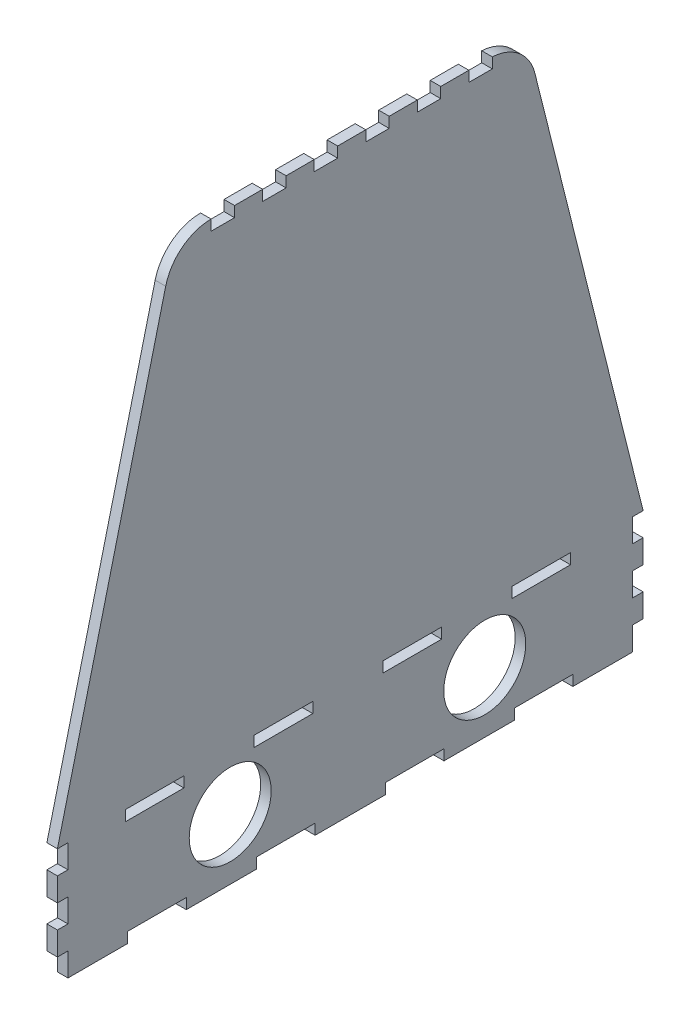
ISO-10303-21;
HEADER;
FILE_DESCRIPTION(('STEP AP214'),'2;1');
FILE_NAME('part.step','',(''),(''),'','','');
FILE_SCHEMA(('AUTOMOTIVE_DESIGN { 1 0 10303 214 1 1 1 1 }'));
ENDSEC;
DATA;
#1=APPLICATION_CONTEXT('core data for automotive mechanical design processes');
#2=APPLICATION_PROTOCOL_DEFINITION('international standard','automotive_design',2000,#1);
#3=PRODUCT_CONTEXT('',#1,'mechanical');
#4=PRODUCT('Part','Part','',(#3));
#5=PRODUCT_RELATED_PRODUCT_CATEGORY('part','',(#4));
#6=PRODUCT_DEFINITION_FORMATION('','',#4);
#7=PRODUCT_DEFINITION_CONTEXT('part definition',#1,'design');
#8=PRODUCT_DEFINITION('design','',#6,#7);
#9=PRODUCT_DEFINITION_SHAPE('','',#8);
#10=(LENGTH_UNIT() NAMED_UNIT(*) SI_UNIT(.MILLI.,.METRE.));
#11=(NAMED_UNIT(*) PLANE_ANGLE_UNIT() SI_UNIT($,.RADIAN.));
#12=(NAMED_UNIT(*) SI_UNIT($,.STERADIAN.) SOLID_ANGLE_UNIT());
#13=UNCERTAINTY_MEASURE_WITH_UNIT(LENGTH_MEASURE(1.E-05),#10,'distance_accuracy_value','');
#14=(GEOMETRIC_REPRESENTATION_CONTEXT(3) GLOBAL_UNCERTAINTY_ASSIGNED_CONTEXT((#13)) GLOBAL_UNIT_ASSIGNED_CONTEXT((#10,
#11,#12)) REPRESENTATION_CONTEXT('',''));
#15=CARTESIAN_POINT('',(0.,0.,0.));
#16=DIRECTION('',(0.,0.,1.));
#17=DIRECTION('',(1.,0.,0.));
#18=AXIS2_PLACEMENT_3D('',#15,#16,#17);
#19=CARTESIAN_POINT('',(9.,-256.43776824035,250.));
#20=DIRECTION('',(0.,0.,-1.));
#21=DIRECTION('',(-1.,0.,0.));
#22=AXIS2_PLACEMENT_3D('',#19,#20,#21);
#23=PLANE('',#22);
#24=DIRECTION('',(0.,-1.,0.));
#25=VECTOR('',#24,1.);
#26=CARTESIAN_POINT('',(0.,-256.43776824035,250.));
#27=LINE('',#26,#25);
#28=CARTESIAN_POINT('',(0.,-276.43776824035,250.));
#29=VERTEX_POINT('',#28);
#30=CARTESIAN_POINT('',(0.,-296.43776824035,250.));
#31=VERTEX_POINT('',#30);
#32=EDGE_CURVE('E635',#29,#31,#27,.T.);
#33=ORIENTED_EDGE('',*,*,#32,.T.);
#34=DIRECTION('',(1.,0.,0.));
#35=VECTOR('',#34,1.);
#36=CARTESIAN_POINT('',(0.,-296.43776824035,250.));
#37=LINE('',#36,#35);
#38=CARTESIAN_POINT('',(9.,-296.43776824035,250.));
#39=VERTEX_POINT('',#38);
#40=EDGE_CURVE('E711',#31,#39,#37,.T.);
#41=ORIENTED_EDGE('',*,*,#40,.T.);
#42=DIRECTION('',(0.,-1.,0.));
#43=VECTOR('',#42,1.);
#44=CARTESIAN_POINT('',(9.,-256.43776824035,250.));
#45=LINE('',#44,#43);
#46=CARTESIAN_POINT('',(9.,-276.43776824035,250.));
#47=VERTEX_POINT('',#46);
#48=EDGE_CURVE('E651',#47,#39,#45,.T.);
#49=ORIENTED_EDGE('',*,*,#48,.F.);
#50=DIRECTION('',(1.,0.,0.));
#51=VECTOR('',#50,1.);
#52=CARTESIAN_POINT('',(0.,-276.43776824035,250.));
#53=LINE('',#52,#51);
#54=EDGE_CURVE('E766',#29,#47,#53,.T.);
#55=ORIENTED_EDGE('',*,*,#54,.F.);
#56=EDGE_LOOP('',(#33,#41,#49,#55));
#57=FACE_BOUND('',#56,.T.);
#58=ADVANCED_FACE('F37',(#57),#23,.F.);
#59=CARTESIAN_POINT('',(9.,-256.437768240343,-250.));
#60=DIRECTION('',(0.,0.,1.));
#61=DIRECTION('',(1.,0.,0.));
#62=AXIS2_PLACEMENT_3D('',#59,#60,#61);
#63=PLANE('',#62);
#64=DIRECTION('',(0.,1.,0.));
#65=VECTOR('',#64,1.);
#66=CARTESIAN_POINT('',(9.,-256.437768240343,-250.));
#67=LINE('',#66,#65);
#68=CARTESIAN_POINT('',(9.,-336.43776824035,-249.999999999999));
#69=VERTEX_POINT('',#68);
#70=CARTESIAN_POINT('',(9.,-316.43776824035,-250.));
#71=VERTEX_POINT('',#70);
#72=EDGE_CURVE('E626',#69,#71,#67,.T.);
#73=ORIENTED_EDGE('',*,*,#72,.F.);
#74=DIRECTION('',(1.,0.,0.));
#75=VECTOR('',#74,1.);
#76=CARTESIAN_POINT('',(0.,-336.43776824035,-249.999999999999));
#77=LINE('',#76,#75);
#78=CARTESIAN_POINT('',(0.,-336.43776824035,-249.999999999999));
#79=VERTEX_POINT('',#78);
#80=EDGE_CURVE('E670',#79,#69,#77,.T.);
#81=ORIENTED_EDGE('',*,*,#80,.F.);
#82=DIRECTION('',(0.,1.,0.));
#83=VECTOR('',#82,1.);
#84=CARTESIAN_POINT('',(0.,-256.437768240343,-250.));
#85=LINE('',#84,#83);
#86=CARTESIAN_POINT('',(0.,-316.43776824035,-250.));
#87=VERTEX_POINT('',#86);
#88=EDGE_CURVE('E561',#79,#87,#85,.T.);
#89=ORIENTED_EDGE('',*,*,#88,.T.);
#90=DIRECTION('',(1.,0.,0.));
#91=VECTOR('',#90,1.);
#92=CARTESIAN_POINT('',(0.,-316.43776824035,-250.));
#93=LINE('',#92,#91);
#94=EDGE_CURVE('E672',#87,#71,#93,.T.);
#95=ORIENTED_EDGE('',*,*,#94,.T.);
#96=EDGE_LOOP('',(#73,#81,#89,#95));
#97=FACE_BOUND('',#96,.T.);
#98=ADVANCED_FACE('F669',(#97),#63,.F.);
#99=CARTESIAN_POINT('',(9.,-356.437768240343,-250.));
#100=DIRECTION('',(0.,1.,0.));
#101=DIRECTION('',(0.,0.,1.));
#102=AXIS2_PLACEMENT_3D('',#99,#100,#101);
#103=PLANE('',#102);
#104=DIRECTION('',(0.,0.,-1.));
#105=VECTOR('',#104,1.);
#106=CARTESIAN_POINT('',(9.,-356.437768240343,-250.));
#107=LINE('',#106,#105);
#108=CARTESIAN_POINT('',(9.,-356.437768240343,140.));
#109=VERTEX_POINT('',#108);
#110=CARTESIAN_POINT('',(9.,-356.437768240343,80.0000000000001));
#111=VERTEX_POINT('',#110);
#112=EDGE_CURVE('E653',#109,#111,#107,.T.);
#113=ORIENTED_EDGE('',*,*,#112,.F.);
#114=DIRECTION('',(-1.,0.,0.));
#115=VECTOR('',#114,1.);
#116=CARTESIAN_POINT('',(9.,-356.437768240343,140.));
#117=LINE('',#116,#115);
#118=CARTESIAN_POINT('',(0.,-356.437768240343,140.));
#119=VERTEX_POINT('',#118);
#120=EDGE_CURVE('E988',#109,#119,#117,.T.);
#121=ORIENTED_EDGE('',*,*,#120,.T.);
#122=DIRECTION('',(0.,0.,-1.));
#123=VECTOR('',#122,1.);
#124=CARTESIAN_POINT('',(0.,-356.437768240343,-250.));
#125=LINE('',#124,#123);
#126=CARTESIAN_POINT('',(0.,-356.437768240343,80.0000000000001));
#127=VERTEX_POINT('',#126);
#128=EDGE_CURVE('E566',#119,#127,#125,.T.);
#129=ORIENTED_EDGE('',*,*,#128,.T.);
#130=DIRECTION('',(-1.,0.,0.));
#131=VECTOR('',#130,1.);
#132=CARTESIAN_POINT('',(9.,-356.437768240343,80.0000000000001));
#133=LINE('',#132,#131);
#134=EDGE_CURVE('E1074',#111,#127,#133,.T.);
#135=ORIENTED_EDGE('',*,*,#134,.F.);
#136=EDGE_LOOP('',(#113,#121,#129,#135));
#137=FACE_BOUND('',#136,.T.);
#138=ADVANCED_FACE('F1191',(#137),#103,.F.);
#139=CARTESIAN_POINT('',(9.,-356.437768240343,-80.));
#140=VERTEX_POINT('',#139);
#141=CARTESIAN_POINT('',(9.,-356.437768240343,-140.));
#142=VERTEX_POINT('',#141);
#143=EDGE_CURVE('E1204',#140,#142,#107,.T.);
#144=ORIENTED_EDGE('',*,*,#143,.F.);
#145=DIRECTION('',(-1.,0.,0.));
#146=VECTOR('',#145,1.);
#147=CARTESIAN_POINT('',(9.,-356.437768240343,-80.));
#148=LINE('',#147,#146);
#149=CARTESIAN_POINT('',(0.,-356.437768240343,-80.));
#150=VERTEX_POINT('',#149);
#151=EDGE_CURVE('E1105',#140,#150,#148,.T.);
#152=ORIENTED_EDGE('',*,*,#151,.T.);
#153=CARTESIAN_POINT('',(0.,-356.437768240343,-140.));
#154=VERTEX_POINT('',#153);
#155=EDGE_CURVE('E1177',#150,#154,#125,.T.);
#156=ORIENTED_EDGE('',*,*,#155,.T.);
#157=DIRECTION('',(-1.,0.,0.));
#158=VECTOR('',#157,1.);
#159=CARTESIAN_POINT('',(9.,-356.437768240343,-140.));
#160=LINE('',#159,#158);
#161=EDGE_CURVE('E1162',#142,#154,#160,.T.);
#162=ORIENTED_EDGE('',*,*,#161,.F.);
#163=EDGE_LOOP('',(#144,#152,#156,#162));
#164=FACE_BOUND('',#163,.T.);
#165=ADVANCED_FACE('F1951',(#164),#103,.F.);
#166=CARTESIAN_POINT('',(0.,-356.437768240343,30.0000000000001));
#167=VERTEX_POINT('',#166);
#168=CARTESIAN_POINT('',(0.,-356.437768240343,-30.));
#169=VERTEX_POINT('',#168);
#170=EDGE_CURVE('E1179',#167,#169,#125,.T.);
#171=ORIENTED_EDGE('',*,*,#170,.T.);
#172=DIRECTION('',(-1.,0.,0.));
#173=VECTOR('',#172,1.);
#174=CARTESIAN_POINT('',(9.,-356.437768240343,-30.));
#175=LINE('',#174,#173);
#176=CARTESIAN_POINT('',(9.,-356.437768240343,-30.));
#177=VERTEX_POINT('',#176);
#178=EDGE_CURVE('E1132',#177,#169,#175,.T.);
#179=ORIENTED_EDGE('',*,*,#178,.F.);
#180=CARTESIAN_POINT('',(9.,-356.437768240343,30.0000000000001));
#181=VERTEX_POINT('',#180);
#182=EDGE_CURVE('E1202',#181,#177,#107,.T.);
#183=ORIENTED_EDGE('',*,*,#182,.F.);
#184=DIRECTION('',(-1.,0.,0.));
#185=VECTOR('',#184,1.);
#186=CARTESIAN_POINT('',(9.,-356.437768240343,30.0000000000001));
#187=LINE('',#186,#185);
#188=EDGE_CURVE('E1047',#181,#167,#187,.T.);
#189=ORIENTED_EDGE('',*,*,#188,.T.);
#190=EDGE_LOOP('',(#171,#179,#183,#189));
#191=FACE_BOUND('',#190,.T.);
#192=ADVANCED_FACE('F1281',(#191),#103,.F.);
#193=CARTESIAN_POINT('',(0.,-356.437768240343,-190.));
#194=VERTEX_POINT('',#193);
#195=CARTESIAN_POINT('',(0.,-356.43776824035,-240.999999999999));
#196=VERTEX_POINT('',#195);
#197=EDGE_CURVE('E568',#194,#196,#125,.T.);
#198=ORIENTED_EDGE('',*,*,#197,.T.);
#199=DIRECTION('',(1.,0.,0.));
#200=VECTOR('',#199,1.);
#201=CARTESIAN_POINT('',(0.,-356.43776824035,-240.999999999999));
#202=LINE('',#201,#200);
#203=CARTESIAN_POINT('',(9.,-356.43776824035,-240.999999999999));
#204=VERTEX_POINT('',#203);
#205=EDGE_CURVE('E737',#196,#204,#202,.T.);
#206=ORIENTED_EDGE('',*,*,#205,.T.);
#207=CARTESIAN_POINT('',(9.,-356.437768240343,-190.));
#208=VERTEX_POINT('',#207);
#209=EDGE_CURVE('E654',#208,#204,#107,.T.);
#210=ORIENTED_EDGE('',*,*,#209,.F.);
#211=DIRECTION('',(-1.,0.,0.));
#212=VECTOR('',#211,1.);
#213=CARTESIAN_POINT('',(9.,-356.437768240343,-190.));
#214=LINE('',#213,#212);
#215=EDGE_CURVE('E647',#208,#194,#214,.T.);
#216=ORIENTED_EDGE('',*,*,#215,.T.);
#217=EDGE_LOOP('',(#198,#206,#210,#216));
#218=FACE_BOUND('',#217,.T.);
#219=ADVANCED_FACE('F1171',(#218),#103,.F.);
#220=CARTESIAN_POINT('',(9.,143.562231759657,-118.768943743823));
#221=DIRECTION('',(0.,-1.,0.));
#222=DIRECTION('',(0.,0.,-1.));
#223=AXIS2_PLACEMENT_3D('',#220,#221,#222);
#224=PLANE('',#223);
#225=DIRECTION('',(0.,0.,1.));
#226=VECTOR('',#225,1.);
#227=CARTESIAN_POINT('',(9.,143.562231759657,-118.768943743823));
#228=LINE('',#227,#226);
#229=CARTESIAN_POINT('',(9.,143.562231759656,30.7689437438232));
#230=VERTEX_POINT('',#229);
#231=CARTESIAN_POINT('',(9.,143.562231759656,54.7689437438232));
#232=VERTEX_POINT('',#231);
#233=EDGE_CURVE('E623',#230,#232,#228,.T.);
#234=ORIENTED_EDGE('',*,*,#233,.F.);
#235=DIRECTION('',(-1.,0.,0.));
#236=VECTOR('',#235,1.);
#237=CARTESIAN_POINT('',(9.,143.562231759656,30.7689437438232));
#238=LINE('',#237,#236);
#239=CARTESIAN_POINT('',(0.,143.562231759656,30.7689437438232));
#240=VERTEX_POINT('',#239);
#241=EDGE_CURVE('E794',#230,#240,#238,.T.);
#242=ORIENTED_EDGE('',*,*,#241,.T.);
#243=DIRECTION('',(0.,0.,1.));
#244=VECTOR('',#243,1.);
#245=CARTESIAN_POINT('',(0.,143.562231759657,-118.768943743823));
#246=LINE('',#245,#244);
#247=CARTESIAN_POINT('',(0.,143.562231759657,54.7689437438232));
#248=VERTEX_POINT('',#247);
#249=EDGE_CURVE('E578',#240,#248,#246,.T.);
#250=ORIENTED_EDGE('',*,*,#249,.T.);
#251=DIRECTION('',(-1.,0.,0.));
#252=VECTOR('',#251,1.);
#253=CARTESIAN_POINT('',(9.,143.562231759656,54.7689437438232));
#254=LINE('',#253,#252);
#255=EDGE_CURVE('E789',#232,#248,#254,.T.);
#256=ORIENTED_EDGE('',*,*,#255,.F.);
#257=EDGE_LOOP('',(#234,#242,#250,#256));
#258=FACE_BOUND('',#257,.T.);
#259=ADVANCED_FACE('F1266',(#258),#224,.F.);
#260=CARTESIAN_POINT('',(9.,143.562231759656,74.7689437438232));
#261=VERTEX_POINT('',#260);
#262=CARTESIAN_POINT('',(9.,143.562231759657,98.7689437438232));
#263=VERTEX_POINT('',#262);
#264=EDGE_CURVE('E620',#261,#263,#228,.T.);
#265=ORIENTED_EDGE('',*,*,#264,.F.);
#266=DIRECTION('',(-1.,0.,0.));
#267=VECTOR('',#266,1.);
#268=CARTESIAN_POINT('',(9.,143.562231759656,74.7689437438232));
#269=LINE('',#268,#267);
#270=CARTESIAN_POINT('',(0.,143.562231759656,74.7689437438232));
#271=VERTEX_POINT('',#270);
#272=EDGE_CURVE('E798',#261,#271,#269,.T.);
#273=ORIENTED_EDGE('',*,*,#272,.T.);
#274=CARTESIAN_POINT('',(0.,143.562231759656,98.7689437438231));
#275=VERTEX_POINT('',#274);
#276=EDGE_CURVE('E575',#271,#275,#246,.T.);
#277=ORIENTED_EDGE('',*,*,#276,.T.);
#278=DIRECTION('',(-1.,0.,0.));
#279=VECTOR('',#278,1.);
#280=CARTESIAN_POINT('',(9.,143.562231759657,98.7689437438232));
#281=LINE('',#280,#279);
#282=EDGE_CURVE('E851',#263,#275,#281,.T.);
#283=ORIENTED_EDGE('',*,*,#282,.F.);
#284=EDGE_LOOP('',(#265,#273,#277,#283));
#285=FACE_BOUND('',#284,.T.);
#286=ADVANCED_FACE('F1258',(#285),#224,.F.);
#287=CARTESIAN_POINT('',(0.,143.562231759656,-13.2310562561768));
#288=VERTEX_POINT('',#287);
#289=CARTESIAN_POINT('',(0.,143.562231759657,10.7689437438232));
#290=VERTEX_POINT('',#289);
#291=EDGE_CURVE('E1325',#288,#290,#246,.T.);
#292=ORIENTED_EDGE('',*,*,#291,.T.);
#293=DIRECTION('',(-1.,0.,0.));
#294=VECTOR('',#293,1.);
#295=CARTESIAN_POINT('',(9.,143.562231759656,10.7689437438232));
#296=LINE('',#295,#294);
#297=CARTESIAN_POINT('',(9.,143.562231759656,10.7689437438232));
#298=VERTEX_POINT('',#297);
#299=EDGE_CURVE('E817',#298,#290,#296,.T.);
#300=ORIENTED_EDGE('',*,*,#299,.F.);
#301=CARTESIAN_POINT('',(9.,143.562231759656,-13.2310562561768));
#302=VERTEX_POINT('',#301);
#303=EDGE_CURVE('E1287',#302,#298,#228,.T.);
#304=ORIENTED_EDGE('',*,*,#303,.F.);
#305=DIRECTION('',(-1.,0.,0.));
#306=VECTOR('',#305,1.);
#307=CARTESIAN_POINT('',(9.,143.562231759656,-13.2310562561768));
#308=LINE('',#307,#306);
#309=EDGE_CURVE('E822',#302,#288,#308,.T.);
#310=ORIENTED_EDGE('',*,*,#309,.T.);
#311=EDGE_LOOP('',(#292,#300,#304,#310));
#312=FACE_BOUND('',#311,.T.);
#313=ADVANCED_FACE('F1251',(#312),#224,.F.);
#314=CARTESIAN_POINT('',(0.,143.562231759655,-57.2310562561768));
#315=VERTEX_POINT('',#314);
#316=CARTESIAN_POINT('',(0.,143.562231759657,-33.2310562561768));
#317=VERTEX_POINT('',#316);
#318=EDGE_CURVE('E1311',#315,#317,#246,.T.);
#319=ORIENTED_EDGE('',*,*,#318,.T.);
#320=DIRECTION('',(-1.,0.,0.));
#321=VECTOR('',#320,1.);
#322=CARTESIAN_POINT('',(9.,143.562231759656,-33.2310562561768));
#323=LINE('',#322,#321);
#324=CARTESIAN_POINT('',(9.,143.562231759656,-33.2310562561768));
#325=VERTEX_POINT('',#324);
#326=EDGE_CURVE('E872',#325,#317,#323,.T.);
#327=ORIENTED_EDGE('',*,*,#326,.F.);
#328=CARTESIAN_POINT('',(9.,143.562231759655,-57.2310562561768));
#329=VERTEX_POINT('',#328);
#330=EDGE_CURVE('E1289',#329,#325,#228,.T.);
#331=ORIENTED_EDGE('',*,*,#330,.F.);
#332=DIRECTION('',(-1.,0.,0.));
#333=VECTOR('',#332,1.);
#334=CARTESIAN_POINT('',(9.,143.562231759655,-57.2310562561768));
#335=LINE('',#334,#333);
#336=EDGE_CURVE('E877',#329,#315,#335,.T.);
#337=ORIENTED_EDGE('',*,*,#336,.T.);
#338=EDGE_LOOP('',(#319,#327,#331,#337));
#339=FACE_BOUND('',#338,.T.);
#340=ADVANCED_FACE('F1245',(#339),#224,.F.);
#341=CARTESIAN_POINT('',(9.,-316.43776824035,250.));
#342=VERTEX_POINT('',#341);
#343=CARTESIAN_POINT('',(9.,-336.43776824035,249.999999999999));
#344=VERTEX_POINT('',#343);
#345=EDGE_CURVE('E585',#342,#344,#45,.T.);
#346=ORIENTED_EDGE('',*,*,#345,.F.);
#347=DIRECTION('',(1.,0.,0.));
#348=VECTOR('',#347,1.);
#349=CARTESIAN_POINT('',(0.,-316.43776824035,250.));
#350=LINE('',#349,#348);
#351=CARTESIAN_POINT('',(0.,-316.43776824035,250.));
#352=VERTEX_POINT('',#351);
#353=EDGE_CURVE('E723',#352,#342,#350,.T.);
#354=ORIENTED_EDGE('',*,*,#353,.F.);
#355=CARTESIAN_POINT('',(0.,-336.43776824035,249.999999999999));
#356=VERTEX_POINT('',#355);
#357=EDGE_CURVE('E633',#352,#356,#27,.T.);
#358=ORIENTED_EDGE('',*,*,#357,.T.);
#359=DIRECTION('',(1.,0.,0.));
#360=VECTOR('',#359,1.);
#361=CARTESIAN_POINT('',(0.,-336.43776824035,249.999999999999));
#362=LINE('',#361,#360);
#363=EDGE_CURVE('E734',#356,#344,#362,.T.);
#364=ORIENTED_EDGE('',*,*,#363,.T.);
#365=EDGE_LOOP('',(#346,#354,#358,#364));
#366=FACE_BOUND('',#365,.T.);
#367=ADVANCED_FACE('F39',(#366),#23,.F.);
#368=CARTESIAN_POINT('',(9.,-356.43776824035,240.999999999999));
#369=VERTEX_POINT('',#368);
#370=CARTESIAN_POINT('',(9.,-356.437768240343,190.));
#371=VERTEX_POINT('',#370);
#372=EDGE_CURVE('E652',#369,#371,#107,.T.);
#373=ORIENTED_EDGE('',*,*,#372,.F.);
#374=DIRECTION('',(1.,0.,0.));
#375=VECTOR('',#374,1.);
#376=CARTESIAN_POINT('',(0.,-356.43776824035,240.999999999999));
#377=LINE('',#376,#375);
#378=CARTESIAN_POINT('',(0.,-356.43776824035,240.999999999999));
#379=VERTEX_POINT('',#378);
#380=EDGE_CURVE('E741',#379,#369,#377,.T.);
#381=ORIENTED_EDGE('',*,*,#380,.F.);
#382=CARTESIAN_POINT('',(0.,-356.437768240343,190.));
#383=VERTEX_POINT('',#382);
#384=EDGE_CURVE('E562',#379,#383,#125,.T.);
#385=ORIENTED_EDGE('',*,*,#384,.T.);
#386=DIRECTION('',(-1.,0.,0.));
#387=VECTOR('',#386,1.);
#388=CARTESIAN_POINT('',(9.,-356.437768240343,190.));
#389=LINE('',#388,#387);
#390=EDGE_CURVE('E1015',#371,#383,#389,.T.);
#391=ORIENTED_EDGE('',*,*,#390,.F.);
#392=EDGE_LOOP('',(#373,#381,#385,#391));
#393=FACE_BOUND('',#392,.T.);
#394=ADVANCED_FACE('F1244',(#393),#103,.F.);
#395=CARTESIAN_POINT('',(0.,-296.43776824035,-250.));
#396=VERTEX_POINT('',#395);
#397=CARTESIAN_POINT('',(0.,-276.43776824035,-250.000000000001));
#398=VERTEX_POINT('',#397);
#399=EDGE_CURVE('E552',#396,#398,#85,.T.);
#400=ORIENTED_EDGE('',*,*,#399,.T.);
#401=DIRECTION('',(1.,0.,0.));
#402=VECTOR('',#401,1.);
#403=CARTESIAN_POINT('',(0.,-276.43776824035,-250.000000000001));
#404=LINE('',#403,#402);
#405=CARTESIAN_POINT('',(9.,-276.43776824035,-250.000000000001));
#406=VERTEX_POINT('',#405);
#407=EDGE_CURVE('E697',#398,#406,#404,.T.);
#408=ORIENTED_EDGE('',*,*,#407,.T.);
#409=CARTESIAN_POINT('',(9.,-296.43776824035,-250.));
#410=VERTEX_POINT('',#409);
#411=EDGE_CURVE('E554',#410,#406,#67,.T.);
#412=ORIENTED_EDGE('',*,*,#411,.F.);
#413=DIRECTION('',(1.,0.,0.));
#414=VECTOR('',#413,1.);
#415=CARTESIAN_POINT('',(0.,-296.43776824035,-250.));
#416=LINE('',#415,#414);
#417=EDGE_CURVE('E538',#396,#410,#416,.T.);
#418=ORIENTED_EDGE('',*,*,#417,.F.);
#419=EDGE_LOOP('',(#400,#408,#412,#418));
#420=FACE_BOUND('',#419,.T.);
#421=ADVANCED_FACE('F550',(#420),#63,.F.);
#422=CARTESIAN_POINT('',(9.,-256.437768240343,-250.));
#423=DIRECTION('',(0.,-0.242535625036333,0.970142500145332));
#424=DIRECTION('',(0.,-0.970142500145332,-0.242535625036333));
#425=AXIS2_PLACEMENT_3D('',#422,#423,#424);
#426=PLANE('',#425);
#427=DIRECTION('',(0.,0.970142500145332,0.242535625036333));
#428=VECTOR('',#427,1.);
#429=CARTESIAN_POINT('',(0.,-256.437768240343,-250.));
#430=LINE('',#429,#428);
#431=CARTESIAN_POINT('',(0.,-256.43776824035,-250.));
#432=VERTEX_POINT('',#431);
#433=CARTESIAN_POINT('',(0.,113.26365676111,-157.574643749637));
#434=VERTEX_POINT('',#433);
#435=EDGE_CURVE('E565',#432,#434,#430,.T.);
#436=ORIENTED_EDGE('',*,*,#435,.T.);
#437=DIRECTION('',(-1.,0.,0.));
#438=VECTOR('',#437,1.);
#439=CARTESIAN_POINT('',(9.,113.26365676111,-157.574643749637));
#440=LINE('',#439,#438);
#441=CARTESIAN_POINT('',(9.,113.26365676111,-157.574643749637));
#442=VERTEX_POINT('',#441);
#443=EDGE_CURVE('E595',#442,#434,#440,.T.);
#444=ORIENTED_EDGE('',*,*,#443,.F.);
#445=DIRECTION('',(0.,0.970142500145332,0.242535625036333));
#446=VECTOR('',#445,1.);
#447=CARTESIAN_POINT('',(9.,-256.437768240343,-250.));
#448=LINE('',#447,#446);
#449=CARTESIAN_POINT('',(9.,-256.43776824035,-250.));
#450=VERTEX_POINT('',#449);
#451=EDGE_CURVE('E603',#450,#442,#448,.T.);
#452=ORIENTED_EDGE('',*,*,#451,.F.);
#453=DIRECTION('',(-1.,0.,0.));
#454=VECTOR('',#453,1.);
#455=CARTESIAN_POINT('',(9.,-256.437768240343,-250.));
#456=LINE('',#455,#454);
#457=EDGE_CURVE('E45',#450,#432,#456,.T.);
#458=ORIENTED_EDGE('',*,*,#457,.T.);
#459=EDGE_LOOP('',(#436,#444,#452,#458));
#460=FACE_BOUND('',#459,.T.);
#461=ADVANCED_FACE('F601',(#460),#426,.F.);
#462=CARTESIAN_POINT('',(9.,103.562231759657,-118.768943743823));
#463=DIRECTION('',(-1.,0.,0.));
#464=DIRECTION('',(0.,0.,1.));
#465=AXIS2_PLACEMENT_3D('',#462,#463,#464);
#466=CYLINDRICAL_SURFACE('',#465,40.);
#467=CARTESIAN_POINT('',(0.,103.562231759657,-118.768943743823));
#468=DIRECTION('',(1.,0.,0.));
#469=DIRECTION('',(0.,0.,-1.));
#470=AXIS2_PLACEMENT_3D('',#467,#468,#469);
#471=CIRCLE('',#470,40.);
#472=CARTESIAN_POINT('',(0.,143.486384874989,-121.231056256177));
#473=VERTEX_POINT('',#472);
#474=EDGE_CURVE('E572',#434,#473,#471,.T.);
#475=ORIENTED_EDGE('',*,*,#474,.T.);
#476=DIRECTION('',(-1.,0.,0.));
#477=VECTOR('',#476,1.);
#478=CARTESIAN_POINT('',(9.,143.486384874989,-121.231056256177));
#479=LINE('',#478,#477);
#480=CARTESIAN_POINT('',(9.,143.486384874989,-121.231056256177));
#481=VERTEX_POINT('',#480);
#482=EDGE_CURVE('E615',#473,#481,#479,.F.);
#483=ORIENTED_EDGE('',*,*,#482,.T.);
#484=CARTESIAN_POINT('',(9.,103.562231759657,-118.768943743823));
#485=DIRECTION('',(1.,0.,0.));
#486=DIRECTION('',(0.,0.,-1.));
#487=AXIS2_PLACEMENT_3D('',#484,#485,#486);
#488=CIRCLE('',#487,40.);
#489=EDGE_CURVE('E617',#442,#481,#488,.T.);
#490=ORIENTED_EDGE('',*,*,#489,.F.);
#491=ORIENTED_EDGE('',*,*,#443,.T.);
#492=EDGE_LOOP('',(#475,#483,#490,#491));
#493=FACE_BOUND('',#492,.T.);
#494=ADVANCED_FACE('F613',(#493),#466,.T.);
#495=CARTESIAN_POINT('',(0.,143.562231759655,-101.231056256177));
#496=VERTEX_POINT('',#495);
#497=CARTESIAN_POINT('',(0.,143.562231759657,-77.2310562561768));
#498=VERTEX_POINT('',#497);
#499=EDGE_CURVE('E579',#496,#498,#246,.T.);
#500=ORIENTED_EDGE('',*,*,#499,.T.);
#501=DIRECTION('',(-1.,0.,0.));
#502=VECTOR('',#501,1.);
#503=CARTESIAN_POINT('',(9.,143.562231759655,-77.2310562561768));
#504=LINE('',#503,#502);
#505=CARTESIAN_POINT('',(9.,143.562231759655,-77.2310562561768));
#506=VERTEX_POINT('',#505);
#507=EDGE_CURVE('E898',#506,#498,#504,.T.);
#508=ORIENTED_EDGE('',*,*,#507,.F.);
#509=CARTESIAN_POINT('',(9.,143.562231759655,-101.231056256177));
#510=VERTEX_POINT('',#509);
#511=EDGE_CURVE('E625',#510,#506,#228,.T.);
#512=ORIENTED_EDGE('',*,*,#511,.F.);
#513=DIRECTION('',(-1.,0.,0.));
#514=VECTOR('',#513,1.);
#515=CARTESIAN_POINT('',(9.,143.562231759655,-101.231056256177));
#516=LINE('',#515,#514);
#517=EDGE_CURVE('E903',#510,#496,#516,.T.);
#518=ORIENTED_EDGE('',*,*,#517,.T.);
#519=EDGE_LOOP('',(#500,#508,#512,#518));
#520=FACE_BOUND('',#519,.T.);
#521=ADVANCED_FACE('F1254',(#520),#224,.F.);
#522=CARTESIAN_POINT('',(9.,103.562231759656,118.768943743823));
#523=DIRECTION('',(-1.,0.,0.));
#524=DIRECTION('',(0.,0.,1.));
#525=AXIS2_PLACEMENT_3D('',#522,#523,#524);
#526=CYLINDRICAL_SURFACE('',#525,40.);
#527=CARTESIAN_POINT('',(0.,103.562231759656,118.768943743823));
#528=DIRECTION('',(1.,0.,0.));
#529=DIRECTION('',(0.,0.,-1.));
#530=AXIS2_PLACEMENT_3D('',#527,#528,#529);
#531=CIRCLE('',#530,40.);
#532=CARTESIAN_POINT('',(0.,143.562231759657,118.768943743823));
#533=VERTEX_POINT('',#532);
#534=CARTESIAN_POINT('',(0.,113.26365676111,157.574643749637));
#535=VERTEX_POINT('',#534);
#536=EDGE_CURVE('E580',#533,#535,#531,.T.);
#537=ORIENTED_EDGE('',*,*,#536,.T.);
#538=DIRECTION('',(-1.,0.,0.));
#539=VECTOR('',#538,1.);
#540=CARTESIAN_POINT('',(9.,113.26365676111,157.574643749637));
#541=LINE('',#540,#539);
#542=CARTESIAN_POINT('',(9.,113.26365676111,157.574643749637));
#543=VERTEX_POINT('',#542);
#544=EDGE_CURVE('E588',#543,#535,#541,.T.);
#545=ORIENTED_EDGE('',*,*,#544,.F.);
#546=CARTESIAN_POINT('',(9.,103.562231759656,118.768943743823));
#547=DIRECTION('',(1.,0.,0.));
#548=DIRECTION('',(0.,0.,-1.));
#549=AXIS2_PLACEMENT_3D('',#546,#547,#548);
#550=CIRCLE('',#549,40.);
#551=CARTESIAN_POINT('',(9.,143.562231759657,118.768943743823));
#552=VERTEX_POINT('',#551);
#553=EDGE_CURVE('E630',#552,#543,#550,.T.);
#554=ORIENTED_EDGE('',*,*,#553,.F.);
#555=DIRECTION('',(-1.,0.,0.));
#556=VECTOR('',#555,1.);
#557=CARTESIAN_POINT('',(9.,143.562231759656,118.768943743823));
#558=LINE('',#557,#556);
#559=EDGE_CURVE('E592',#552,#533,#558,.T.);
#560=ORIENTED_EDGE('',*,*,#559,.T.);
#561=EDGE_LOOP('',(#537,#545,#554,#560));
#562=FACE_BOUND('',#561,.T.);
#563=ADVANCED_FACE('F1264',(#562),#526,.T.);
#564=CARTESIAN_POINT('',(9.,113.26365676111,157.574643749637));
#565=DIRECTION('',(0.,-0.242535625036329,-0.970142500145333));
#566=DIRECTION('',(0.,0.970142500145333,-0.242535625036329));
#567=AXIS2_PLACEMENT_3D('',#564,#565,#566);
#568=PLANE('',#567);
#569=DIRECTION('',(0.,-0.970142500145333,0.242535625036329));
#570=VECTOR('',#569,1.);
#571=CARTESIAN_POINT('',(0.,113.26365676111,157.574643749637));
#572=LINE('',#571,#570);
#573=CARTESIAN_POINT('',(0.,-256.43776824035,250.));
#574=VERTEX_POINT('',#573);
#575=EDGE_CURVE('E582',#535,#574,#572,.T.);
#576=ORIENTED_EDGE('',*,*,#575,.T.);
#577=DIRECTION('',(-1.,0.,0.));
#578=VECTOR('',#577,1.);
#579=CARTESIAN_POINT('',(9.,-256.43776824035,250.));
#580=LINE('',#579,#578);
#581=CARTESIAN_POINT('',(9.,-256.43776824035,250.));
#582=VERTEX_POINT('',#581);
#583=EDGE_CURVE('E586',#582,#574,#580,.T.);
#584=ORIENTED_EDGE('',*,*,#583,.F.);
#585=DIRECTION('',(0.,-0.970142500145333,0.242535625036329));
#586=VECTOR('',#585,1.);
#587=CARTESIAN_POINT('',(9.,113.26365676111,157.574643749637));
#588=LINE('',#587,#586);
#589=EDGE_CURVE('E589',#543,#582,#588,.T.);
#590=ORIENTED_EDGE('',*,*,#589,.F.);
#591=ORIENTED_EDGE('',*,*,#544,.T.);
#592=EDGE_LOOP('',(#576,#584,#590,#591));
#593=FACE_BOUND('',#592,.T.);
#594=ADVANCED_FACE('F1271',(#593),#568,.F.);
#595=CARTESIAN_POINT('',(9.,103.562231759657,-118.768943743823));
#596=DIRECTION('',(1.,0.,0.));
#597=DIRECTION('',(0.,0.,-1.));
#598=AXIS2_PLACEMENT_3D('',#595,#596,#597);
#599=PLANE('',#598);
#600=DIRECTION('',(0.,0.,-1.));
#601=VECTOR('',#600,1.);
#602=CARTESIAN_POINT('',(9.,-276.43776824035,-250.000000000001));
#603=LINE('',#602,#601);
#604=CARTESIAN_POINT('',(9.,-276.43776824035,-241.));
#605=VERTEX_POINT('',#604);
#606=EDGE_CURVE('E686',#605,#406,#603,.T.);
#607=ORIENTED_EDGE('',*,*,#606,.F.);
#608=DIRECTION('',(0.,-1.,0.));
#609=VECTOR('',#608,1.);
#610=CARTESIAN_POINT('',(9.,-256.43776824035,-241.));
#611=LINE('',#610,#609);
#612=CARTESIAN_POINT('',(9.,-256.43776824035,-241.));
#613=VERTEX_POINT('',#612);
#614=EDGE_CURVE('E692',#613,#605,#611,.T.);
#615=ORIENTED_EDGE('',*,*,#614,.F.);
#616=DIRECTION('',(0.,0.,1.));
#617=VECTOR('',#616,1.);
#618=CARTESIAN_POINT('',(9.,-256.43776824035,-250.));
#619=LINE('',#618,#617);
#620=EDGE_CURVE('E690',#450,#613,#619,.T.);
#621=ORIENTED_EDGE('',*,*,#620,.F.);
#622=ORIENTED_EDGE('',*,*,#451,.T.);
#623=ORIENTED_EDGE('',*,*,#489,.T.);
#624=DIRECTION('',(0.,-1.,0.));
#625=VECTOR('',#624,1.);
#626=CARTESIAN_POINT('',(9.,143.562231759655,-121.231056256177));
#627=LINE('',#626,#625);
#628=CARTESIAN_POINT('',(9.,134.562231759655,-121.231056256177));
#629=VERTEX_POINT('',#628);
#630=EDGE_CURVE('E914',#481,#629,#627,.T.);
#631=ORIENTED_EDGE('',*,*,#630,.T.);
#632=DIRECTION('',(0.,0.,1.));
#633=VECTOR('',#632,1.);
#634=CARTESIAN_POINT('',(9.,134.562231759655,-101.231056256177));
#635=LINE('',#634,#633);
#636=CARTESIAN_POINT('',(9.,134.562231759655,-101.231056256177));
#637=VERTEX_POINT('',#636);
#638=EDGE_CURVE('E916',#629,#637,#635,.T.);
#639=ORIENTED_EDGE('',*,*,#638,.T.);
#640=DIRECTION('',(0.,1.,0.));
#641=VECTOR('',#640,1.);
#642=CARTESIAN_POINT('',(9.,143.562231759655,-101.231056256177));
#643=LINE('',#642,#641);
#644=EDGE_CURVE('E920',#637,#510,#643,.T.);
#645=ORIENTED_EDGE('',*,*,#644,.T.);
#646=ORIENTED_EDGE('',*,*,#511,.T.);
#647=DIRECTION('',(0.,-1.,0.));
#648=VECTOR('',#647,1.);
#649=CARTESIAN_POINT('',(9.,143.562231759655,-77.2310562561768));
#650=LINE('',#649,#648);
#651=CARTESIAN_POINT('',(9.,134.562231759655,-77.2310562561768));
#652=VERTEX_POINT('',#651);
#653=EDGE_CURVE('E888',#506,#652,#650,.T.);
#654=ORIENTED_EDGE('',*,*,#653,.T.);
#655=DIRECTION('',(0.,0.,1.));
#656=VECTOR('',#655,1.);
#657=CARTESIAN_POINT('',(9.,134.562231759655,-57.2310562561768));
#658=LINE('',#657,#656);
#659=CARTESIAN_POINT('',(9.,134.562231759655,-57.2310562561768));
#660=VERTEX_POINT('',#659);
#661=EDGE_CURVE('E891',#652,#660,#658,.T.);
#662=ORIENTED_EDGE('',*,*,#661,.T.);
#663=DIRECTION('',(0.,1.,0.));
#664=VECTOR('',#663,1.);
#665=CARTESIAN_POINT('',(9.,143.562231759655,-57.2310562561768));
#666=LINE('',#665,#664);
#667=EDGE_CURVE('E895',#660,#329,#666,.T.);
#668=ORIENTED_EDGE('',*,*,#667,.T.);
#669=ORIENTED_EDGE('',*,*,#330,.T.);
#670=DIRECTION('',(0.,-1.,0.));
#671=VECTOR('',#670,1.);
#672=CARTESIAN_POINT('',(9.,143.562231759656,-33.2310562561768));
#673=LINE('',#672,#671);
#674=CARTESIAN_POINT('',(9.,134.562231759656,-33.2310562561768));
#675=VERTEX_POINT('',#674);
#676=EDGE_CURVE('E862',#325,#675,#673,.T.);
#677=ORIENTED_EDGE('',*,*,#676,.T.);
#678=DIRECTION('',(0.,0.,1.));
#679=VECTOR('',#678,1.);
#680=CARTESIAN_POINT('',(9.,134.562231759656,-13.2310562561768));
#681=LINE('',#680,#679);
#682=CARTESIAN_POINT('',(9.,134.562231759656,-13.2310562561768));
#683=VERTEX_POINT('',#682);
#684=EDGE_CURVE('E865',#675,#683,#681,.T.);
#685=ORIENTED_EDGE('',*,*,#684,.T.);
#686=DIRECTION('',(0.,1.,0.));
#687=VECTOR('',#686,1.);
#688=CARTESIAN_POINT('',(9.,143.562231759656,-13.2310562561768));
#689=LINE('',#688,#687);
#690=EDGE_CURVE('E869',#683,#302,#689,.T.);
#691=ORIENTED_EDGE('',*,*,#690,.T.);
#692=ORIENTED_EDGE('',*,*,#303,.T.);
#693=DIRECTION('',(0.,-1.,0.));
#694=VECTOR('',#693,1.);
#695=CARTESIAN_POINT('',(9.,143.562231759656,10.7689437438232));
#696=LINE('',#695,#694);
#697=CARTESIAN_POINT('',(9.,134.562231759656,10.7689437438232));
#698=VERTEX_POINT('',#697);
#699=EDGE_CURVE('E807',#298,#698,#696,.T.);
#700=ORIENTED_EDGE('',*,*,#699,.T.);
#701=DIRECTION('',(0.,0.,1.));
#702=VECTOR('',#701,1.);
#703=CARTESIAN_POINT('',(9.,134.562231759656,30.7689437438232));
#704=LINE('',#703,#702);
#705=CARTESIAN_POINT('',(9.,134.562231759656,30.7689437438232));
#706=VERTEX_POINT('',#705);
#707=EDGE_CURVE('E810',#698,#706,#704,.T.);
#708=ORIENTED_EDGE('',*,*,#707,.T.);
#709=DIRECTION('',(0.,1.,0.));
#710=VECTOR('',#709,1.);
#711=CARTESIAN_POINT('',(9.,143.562231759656,30.7689437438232));
#712=LINE('',#711,#710);
#713=EDGE_CURVE('E814',#706,#230,#712,.T.);
#714=ORIENTED_EDGE('',*,*,#713,.T.);
#715=ORIENTED_EDGE('',*,*,#233,.T.);
#716=DIRECTION('',(0.,-1.,0.));
#717=VECTOR('',#716,1.);
#718=CARTESIAN_POINT('',(9.,143.562231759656,54.7689437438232));
#719=LINE('',#718,#717);
#720=CARTESIAN_POINT('',(9.,134.562231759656,54.7689437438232));
#721=VERTEX_POINT('',#720);
#722=EDGE_CURVE('E779',#232,#721,#719,.T.);
#723=ORIENTED_EDGE('',*,*,#722,.T.);
#724=DIRECTION('',(0.,0.,1.));
#725=VECTOR('',#724,1.);
#726=CARTESIAN_POINT('',(9.,134.562231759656,74.7689437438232));
#727=LINE('',#726,#725);
#728=CARTESIAN_POINT('',(9.,134.562231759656,74.7689437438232));
#729=VERTEX_POINT('',#728);
#730=EDGE_CURVE('E782',#721,#729,#727,.T.);
#731=ORIENTED_EDGE('',*,*,#730,.T.);
#732=DIRECTION('',(0.,1.,0.));
#733=VECTOR('',#732,1.);
#734=CARTESIAN_POINT('',(9.,143.562231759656,74.7689437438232));
#735=LINE('',#734,#733);
#736=EDGE_CURVE('E786',#729,#261,#735,.T.);
#737=ORIENTED_EDGE('',*,*,#736,.T.);
#738=ORIENTED_EDGE('',*,*,#264,.T.);
#739=DIRECTION('',(0.,-1.,0.));
#740=VECTOR('',#739,1.);
#741=CARTESIAN_POINT('',(9.,143.562231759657,98.7689437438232));
#742=LINE('',#741,#740);
#743=CARTESIAN_POINT('',(9.,134.562231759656,98.7689437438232));
#744=VERTEX_POINT('',#743);
#745=EDGE_CURVE('E844',#263,#744,#742,.T.);
#746=ORIENTED_EDGE('',*,*,#745,.T.);
#747=DIRECTION('',(0.,0.,1.));
#748=VECTOR('',#747,1.);
#749=CARTESIAN_POINT('',(9.,134.562231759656,118.768943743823));
#750=LINE('',#749,#748);
#751=CARTESIAN_POINT('',(9.,134.562231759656,118.768943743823));
#752=VERTEX_POINT('',#751);
#753=EDGE_CURVE('E848',#744,#752,#750,.T.);
#754=ORIENTED_EDGE('',*,*,#753,.T.);
#755=DIRECTION('',(0.,1.,0.));
#756=VECTOR('',#755,1.);
#757=CARTESIAN_POINT('',(9.,143.562231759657,118.768943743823));
#758=LINE('',#757,#756);
#759=EDGE_CURVE('E841',#752,#552,#758,.T.);
#760=ORIENTED_EDGE('',*,*,#759,.T.);
#761=ORIENTED_EDGE('',*,*,#553,.T.);
#762=ORIENTED_EDGE('',*,*,#589,.T.);
#763=DIRECTION('',(0.,0.,1.));
#764=VECTOR('',#763,1.);
#765=CARTESIAN_POINT('',(9.,-256.43776824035,250.));
#766=LINE('',#765,#764);
#767=CARTESIAN_POINT('',(9.,-256.43776824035,241.));
#768=VERTEX_POINT('',#767);
#769=EDGE_CURVE('E760',#768,#582,#766,.T.);
#770=ORIENTED_EDGE('',*,*,#769,.F.);
#771=DIRECTION('',(0.,1.,0.));
#772=VECTOR('',#771,1.);
#773=CARTESIAN_POINT('',(9.,-256.43776824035,241.));
#774=LINE('',#773,#772);
#775=CARTESIAN_POINT('',(9.,-276.43776824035,241.));
#776=VERTEX_POINT('',#775);
#777=EDGE_CURVE('E769',#776,#768,#774,.T.);
#778=ORIENTED_EDGE('',*,*,#777,.F.);
#779=DIRECTION('',(0.,0.,-1.));
#780=VECTOR('',#779,1.);
#781=CARTESIAN_POINT('',(9.,-276.43776824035,250.));
#782=LINE('',#781,#780);
#783=EDGE_CURVE('E699',#47,#776,#782,.T.);
#784=ORIENTED_EDGE('',*,*,#783,.F.);
#785=ORIENTED_EDGE('',*,*,#48,.T.);
#786=DIRECTION('',(0.,0.,1.));
#787=VECTOR('',#786,1.);
#788=CARTESIAN_POINT('',(9.,-296.43776824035,250.));
#789=LINE('',#788,#787);
#790=CARTESIAN_POINT('',(9.,-296.43776824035,241.));
#791=VERTEX_POINT('',#790);
#792=EDGE_CURVE('E712',#791,#39,#789,.T.);
#793=ORIENTED_EDGE('',*,*,#792,.F.);
#794=DIRECTION('',(0.,1.,0.));
#795=VECTOR('',#794,1.);
#796=CARTESIAN_POINT('',(9.,-296.43776824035,241.));
#797=LINE('',#796,#795);
#798=CARTESIAN_POINT('',(9.,-316.43776824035,241.));
#799=VERTEX_POINT('',#798);
#800=EDGE_CURVE('E707',#799,#791,#797,.T.);
#801=ORIENTED_EDGE('',*,*,#800,.F.);
#802=DIRECTION('',(0.,0.,-1.));
#803=VECTOR('',#802,1.);
#804=CARTESIAN_POINT('',(9.,-316.43776824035,250.));
#805=LINE('',#804,#803);
#806=EDGE_CURVE('E714',#342,#799,#805,.T.);
#807=ORIENTED_EDGE('',*,*,#806,.F.);
#808=ORIENTED_EDGE('',*,*,#345,.T.);
#809=DIRECTION('',(0.,0.,1.));
#810=VECTOR('',#809,1.);
#811=CARTESIAN_POINT('',(9.,-336.43776824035,249.999999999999));
#812=LINE('',#811,#810);
#813=CARTESIAN_POINT('',(9.,-336.43776824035,240.999999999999));
#814=VERTEX_POINT('',#813);
#815=EDGE_CURVE('E735',#814,#344,#812,.T.);
#816=ORIENTED_EDGE('',*,*,#815,.F.);
#817=DIRECTION('',(0.,1.,0.));
#818=VECTOR('',#817,1.);
#819=CARTESIAN_POINT('',(9.,-336.43776824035,240.999999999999));
#820=LINE('',#819,#818);
#821=EDGE_CURVE('E731',#369,#814,#820,.T.);
#822=ORIENTED_EDGE('',*,*,#821,.F.);
#823=ORIENTED_EDGE('',*,*,#372,.T.);
#824=DIRECTION('',(0.,1.,0.));
#825=VECTOR('',#824,1.);
#826=CARTESIAN_POINT('',(9.,-356.437768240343,190.));
#827=LINE('',#826,#825);
#828=CARTESIAN_POINT('',(9.,-347.437768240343,190.));
#829=VERTEX_POINT('',#828);
#830=EDGE_CURVE('E1005',#371,#829,#827,.T.);
#831=ORIENTED_EDGE('',*,*,#830,.T.);
#832=DIRECTION('',(0.,0.,-1.));
#833=VECTOR('',#832,1.);
#834=CARTESIAN_POINT('',(9.,-347.437768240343,140.));
#835=LINE('',#834,#833);
#836=CARTESIAN_POINT('',(9.,-347.437768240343,140.));
#837=VERTEX_POINT('',#836);
#838=EDGE_CURVE('E1008',#829,#837,#835,.T.);
#839=ORIENTED_EDGE('',*,*,#838,.T.);
#840=DIRECTION('',(0.,-1.,0.));
#841=VECTOR('',#840,1.);
#842=CARTESIAN_POINT('',(9.,-356.437768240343,140.));
#843=LINE('',#842,#841);
#844=EDGE_CURVE('E1012',#837,#109,#843,.T.);
#845=ORIENTED_EDGE('',*,*,#844,.T.);
#846=ORIENTED_EDGE('',*,*,#112,.T.);
#847=DIRECTION('',(0.,1.,0.));
#848=VECTOR('',#847,1.);
#849=CARTESIAN_POINT('',(9.,-356.437768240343,80.0000000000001));
#850=LINE('',#849,#848);
#851=CARTESIAN_POINT('',(9.,-347.437768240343,80.0000000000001));
#852=VERTEX_POINT('',#851);
#853=EDGE_CURVE('E1064',#111,#852,#850,.T.);
#854=ORIENTED_EDGE('',*,*,#853,.T.);
#855=DIRECTION('',(0.,0.,-1.));
#856=VECTOR('',#855,1.);
#857=CARTESIAN_POINT('',(9.,-347.437768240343,30.0000000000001));
#858=LINE('',#857,#856);
#859=CARTESIAN_POINT('',(9.,-347.437768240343,30.0000000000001));
#860=VERTEX_POINT('',#859);
#861=EDGE_CURVE('E1067',#852,#860,#858,.T.);
#862=ORIENTED_EDGE('',*,*,#861,.T.);
#863=DIRECTION('',(0.,-1.,0.));
#864=VECTOR('',#863,1.);
#865=CARTESIAN_POINT('',(9.,-356.437768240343,30.0000000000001));
#866=LINE('',#865,#864);
#867=EDGE_CURVE('E1071',#860,#181,#866,.T.);
#868=ORIENTED_EDGE('',*,*,#867,.T.);
#869=ORIENTED_EDGE('',*,*,#182,.T.);
#870=DIRECTION('',(0.,1.,0.));
#871=VECTOR('',#870,1.);
#872=CARTESIAN_POINT('',(9.,-356.437768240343,-30.));
#873=LINE('',#872,#871);
#874=CARTESIAN_POINT('',(9.,-347.437768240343,-30.));
#875=VERTEX_POINT('',#874);
#876=EDGE_CURVE('E1122',#177,#875,#873,.T.);
#877=ORIENTED_EDGE('',*,*,#876,.T.);
#878=DIRECTION('',(0.,0.,-1.));
#879=VECTOR('',#878,1.);
#880=CARTESIAN_POINT('',(9.,-347.437768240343,-80.));
#881=LINE('',#880,#879);
#882=CARTESIAN_POINT('',(9.,-347.437768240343,-80.));
#883=VERTEX_POINT('',#882);
#884=EDGE_CURVE('E1125',#875,#883,#881,.T.);
#885=ORIENTED_EDGE('',*,*,#884,.T.);
#886=DIRECTION('',(0.,-1.,0.));
#887=VECTOR('',#886,1.);
#888=CARTESIAN_POINT('',(9.,-356.437768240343,-80.));
#889=LINE('',#888,#887);
#890=EDGE_CURVE('E1129',#883,#140,#889,.T.);
#891=ORIENTED_EDGE('',*,*,#890,.T.);
#892=ORIENTED_EDGE('',*,*,#143,.T.);
#893=DIRECTION('',(0.,1.,0.));
#894=VECTOR('',#893,1.);
#895=CARTESIAN_POINT('',(9.,-356.437768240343,-140.));
#896=LINE('',#895,#894);
#897=CARTESIAN_POINT('',(9.,-347.437768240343,-140.));
#898=VERTEX_POINT('',#897);
#899=EDGE_CURVE('E1149',#142,#898,#896,.T.);
#900=ORIENTED_EDGE('',*,*,#899,.T.);
#901=DIRECTION('',(0.,0.,-1.));
#902=VECTOR('',#901,1.);
#903=CARTESIAN_POINT('',(9.,-347.437768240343,-190.));
#904=LINE('',#903,#902);
#905=CARTESIAN_POINT('',(9.,-347.437768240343,-190.));
#906=VERTEX_POINT('',#905);
#907=EDGE_CURVE('E1153',#898,#906,#904,.T.);
#908=ORIENTED_EDGE('',*,*,#907,.T.);
#909=DIRECTION('',(0.,-1.,0.));
#910=VECTOR('',#909,1.);
#911=CARTESIAN_POINT('',(9.,-356.437768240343,-190.));
#912=LINE('',#911,#910);
#913=EDGE_CURVE('E1146',#906,#208,#912,.T.);
#914=ORIENTED_EDGE('',*,*,#913,.T.);
#915=ORIENTED_EDGE('',*,*,#209,.T.);
#916=DIRECTION('',(0.,-1.,0.));
#917=VECTOR('',#916,1.);
#918=CARTESIAN_POINT('',(9.,-336.43776824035,-240.999999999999));
#919=LINE('',#918,#917);
#920=CARTESIAN_POINT('',(9.,-336.43776824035,-240.999999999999));
#921=VERTEX_POINT('',#920);
#922=EDGE_CURVE('E678',#921,#204,#919,.T.);
#923=ORIENTED_EDGE('',*,*,#922,.F.);
#924=DIRECTION('',(0.,0.,1.));
#925=VECTOR('',#924,1.);
#926=CARTESIAN_POINT('',(9.,-336.43776824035,-249.999999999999));
#927=LINE('',#926,#925);
#928=EDGE_CURVE('E665',#69,#921,#927,.T.);
#929=ORIENTED_EDGE('',*,*,#928,.F.);
#930=ORIENTED_EDGE('',*,*,#72,.T.);
#931=DIRECTION('',(0.,0.,-1.));
#932=VECTOR('',#931,1.);
#933=CARTESIAN_POINT('',(9.,-316.43776824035,-250.));
#934=LINE('',#933,#932);
#935=CARTESIAN_POINT('',(9.,-316.43776824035,-241.));
#936=VERTEX_POINT('',#935);
#937=EDGE_CURVE('E545',#936,#71,#934,.T.);
#938=ORIENTED_EDGE('',*,*,#937,.F.);
#939=DIRECTION('',(0.,-1.,0.));
#940=VECTOR('',#939,1.);
#941=CARTESIAN_POINT('',(9.,-296.43776824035,-241.));
#942=LINE('',#941,#940);
#943=CARTESIAN_POINT('',(9.,-296.43776824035,-241.));
#944=VERTEX_POINT('',#943);
#945=EDGE_CURVE('E1639',#944,#936,#942,.T.);
#946=ORIENTED_EDGE('',*,*,#945,.F.);
#947=DIRECTION('',(0.,0.,1.));
#948=VECTOR('',#947,1.);
#949=CARTESIAN_POINT('',(9.,-296.43776824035,-250.));
#950=LINE('',#949,#948);
#951=EDGE_CURVE('E1640',#410,#944,#950,.T.);
#952=ORIENTED_EDGE('',*,*,#951,.F.);
#953=ORIENTED_EDGE('',*,*,#411,.T.);
#954=EDGE_LOOP('',(#607,#615,#621,#622,#623,#631,#639,#645,#646,#654,#662,#668,#669,#677,#685,
#691,#692,#700,#708,#714,#715,#723,#731,#737,#738,#746,#754,#760,#761,#762,#770,#778,#784,#785,
#793,#801,#807,#808,#816,#822,#823,#831,#839,#845,#846,#854,#862,#868,#869,#877,#885,#891,#892,
#900,#908,#914,#915,#923,#929,#930,#938,#946,#952,#953));
#955=FACE_BOUND('',#954,.T.);
#956=DIRECTION('',(0.,0.,-1.));
#957=VECTOR('',#956,1.);
#958=CARTESIAN_POINT('',(9.,-256.437768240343,32.0000000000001));
#959=LINE('',#958,#957);
#960=CARTESIAN_POINT('',(9.,-256.437768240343,82.));
#961=VERTEX_POINT('',#960);
#962=CARTESIAN_POINT('',(9.,-256.437768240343,32.0000000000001));
#963=VERTEX_POINT('',#962);
#964=EDGE_CURVE('E971',#961,#963,#959,.T.);
#965=ORIENTED_EDGE('',*,*,#964,.T.);
#966=DIRECTION('',(0.,-1.,0.));
#967=VECTOR('',#966,1.);
#968=CARTESIAN_POINT('',(9.,-256.437768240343,32.0000000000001));
#969=LINE('',#968,#967);
#970=CARTESIAN_POINT('',(9.,-265.437768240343,32.0000000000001));
#971=VERTEX_POINT('',#970);
#972=EDGE_CURVE('E974',#963,#971,#969,.T.);
#973=ORIENTED_EDGE('',*,*,#972,.T.);
#974=DIRECTION('',(0.,0.,1.));
#975=VECTOR('',#974,1.);
#976=CARTESIAN_POINT('',(9.,-265.437768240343,32.0000000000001));
#977=LINE('',#976,#975);
#978=CARTESIAN_POINT('',(9.,-265.437768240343,82.0000000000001));
#979=VERTEX_POINT('',#978);
#980=EDGE_CURVE('E978',#971,#979,#977,.T.);
#981=ORIENTED_EDGE('',*,*,#980,.T.);
#982=DIRECTION('',(0.,1.,0.));
#983=VECTOR('',#982,1.);
#984=CARTESIAN_POINT('',(9.,-256.437768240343,82.));
#985=LINE('',#984,#983);
#986=EDGE_CURVE('E981',#979,#961,#985,.T.);
#987=ORIENTED_EDGE('',*,*,#986,.T.);
#988=EDGE_LOOP('',(#965,#973,#981,#987));
#989=FACE_BOUND('',#988,.T.);
#990=DIRECTION('',(0.,0.,-1.));
#991=VECTOR('',#990,1.);
#992=CARTESIAN_POINT('',(9.,-256.437768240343,142.));
#993=LINE('',#992,#991);
#994=CARTESIAN_POINT('',(9.,-256.437768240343,192.));
#995=VERTEX_POINT('',#994);
#996=CARTESIAN_POINT('',(9.,-256.437768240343,142.));
#997=VERTEX_POINT('',#996);
#998=EDGE_CURVE('E933',#995,#997,#993,.T.);
#999=ORIENTED_EDGE('',*,*,#998,.T.);
#1000=DIRECTION('',(0.,-1.,0.));
#1001=VECTOR('',#1000,1.);
#1002=CARTESIAN_POINT('',(9.,-256.437768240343,142.));
#1003=LINE('',#1002,#1001);
#1004=CARTESIAN_POINT('',(9.,-265.437768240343,142.));
#1005=VERTEX_POINT('',#1004);
#1006=EDGE_CURVE('E936',#997,#1005,#1003,.T.);
#1007=ORIENTED_EDGE('',*,*,#1006,.T.);
#1008=DIRECTION('',(0.,0.,1.));
#1009=VECTOR('',#1008,1.);
#1010=CARTESIAN_POINT('',(9.,-265.437768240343,142.));
#1011=LINE('',#1010,#1009);
#1012=CARTESIAN_POINT('',(9.,-265.437768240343,192.));
#1013=VERTEX_POINT('',#1012);
#1014=EDGE_CURVE('E940',#1005,#1013,#1011,.T.);
#1015=ORIENTED_EDGE('',*,*,#1014,.T.);
#1016=DIRECTION('',(0.,1.,0.));
#1017=VECTOR('',#1016,1.);
#1018=CARTESIAN_POINT('',(9.,-256.437768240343,192.));
#1019=LINE('',#1018,#1017);
#1020=EDGE_CURVE('E943',#1013,#995,#1019,.T.);
#1021=ORIENTED_EDGE('',*,*,#1020,.T.);
#1022=EDGE_LOOP('',(#999,#1007,#1015,#1021));
#1023=FACE_BOUND('',#1022,.T.);
#1024=CARTESIAN_POINT('',(9.,-304.747962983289,-114.807518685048));
#1025=DIRECTION('',(-1.,0.,0.));
#1026=DIRECTION('',(0.,0.,1.));
#1027=AXIS2_PLACEMENT_3D('',#1024,#1025,#1026);
#1028=CIRCLE('',#1027,35.);
#1029=CARTESIAN_POINT('',(9.,-304.747962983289,-79.8075186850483));
#1030=VERTEX_POINT('',#1029);
#1031=EDGE_CURVE('E950',#1030,#1030,#1028,.T.);
#1032=ORIENTED_EDGE('',*,*,#1031,.T.);
#1033=EDGE_LOOP('',(#1032));
#1034=FACE_BOUND('',#1033,.T.);
#1035=DIRECTION('',(0.,-1.,0.));
#1036=VECTOR('',#1035,1.);
#1037=CARTESIAN_POINT('',(9.,-256.437768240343,-188.));
#1038=LINE('',#1037,#1036);
#1039=CARTESIAN_POINT('',(9.,-256.437768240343,-188.));
#1040=VERTEX_POINT('',#1039);
#1041=CARTESIAN_POINT('',(9.,-265.437768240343,-188.));
#1042=VERTEX_POINT('',#1041);
#1043=EDGE_CURVE('E1088',#1040,#1042,#1038,.T.);
#1044=ORIENTED_EDGE('',*,*,#1043,.T.);
#1045=DIRECTION('',(0.,0.,1.));
#1046=VECTOR('',#1045,1.);
#1047=CARTESIAN_POINT('',(9.,-265.437768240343,-188.));
#1048=LINE('',#1047,#1046);
#1049=CARTESIAN_POINT('',(9.,-265.437768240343,-138.));
#1050=VERTEX_POINT('',#1049);
#1051=EDGE_CURVE('E1091',#1042,#1050,#1048,.T.);
#1052=ORIENTED_EDGE('',*,*,#1051,.T.);
#1053=DIRECTION('',(0.,1.,0.));
#1054=VECTOR('',#1053,1.);
#1055=CARTESIAN_POINT('',(9.,-256.437768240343,-138.));
#1056=LINE('',#1055,#1054);
#1057=CARTESIAN_POINT('',(9.,-256.437768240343,-138.));
#1058=VERTEX_POINT('',#1057);
#1059=EDGE_CURVE('E1095',#1050,#1058,#1056,.T.);
#1060=ORIENTED_EDGE('',*,*,#1059,.T.);
#1061=DIRECTION('',(0.,0.,-1.));
#1062=VECTOR('',#1061,1.);
#1063=CARTESIAN_POINT('',(9.,-256.437768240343,-188.));
#1064=LINE('',#1063,#1062);
#1065=EDGE_CURVE('E1098',#1058,#1040,#1064,.T.);
#1066=ORIENTED_EDGE('',*,*,#1065,.T.);
#1067=EDGE_LOOP('',(#1044,#1052,#1060,#1066));
#1068=FACE_BOUND('',#1067,.T.);
#1069=DIRECTION('',(0.,0.,-1.));
#1070=VECTOR('',#1069,1.);
#1071=CARTESIAN_POINT('',(9.,-256.437768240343,-78.));
#1072=LINE('',#1071,#1070);
#1073=CARTESIAN_POINT('',(9.,-256.437768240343,-28.));
#1074=VERTEX_POINT('',#1073);
#1075=CARTESIAN_POINT('',(9.,-256.437768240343,-78.));
#1076=VERTEX_POINT('',#1075);
#1077=EDGE_CURVE('E1030',#1074,#1076,#1072,.T.);
#1078=ORIENTED_EDGE('',*,*,#1077,.T.);
#1079=DIRECTION('',(0.,-1.,0.));
#1080=VECTOR('',#1079,1.);
#1081=CARTESIAN_POINT('',(9.,-256.437768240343,-78.));
#1082=LINE('',#1081,#1080);
#1083=CARTESIAN_POINT('',(9.,-265.437768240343,-78.));
#1084=VERTEX_POINT('',#1083);
#1085=EDGE_CURVE('E1033',#1076,#1084,#1082,.T.);
#1086=ORIENTED_EDGE('',*,*,#1085,.T.);
#1087=DIRECTION('',(0.,0.,1.));
#1088=VECTOR('',#1087,1.);
#1089=CARTESIAN_POINT('',(9.,-265.437768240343,-78.));
#1090=LINE('',#1089,#1088);
#1091=CARTESIAN_POINT('',(9.,-265.437768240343,-28.));
#1092=VERTEX_POINT('',#1091);
#1093=EDGE_CURVE('E1037',#1084,#1092,#1090,.T.);
#1094=ORIENTED_EDGE('',*,*,#1093,.T.);
#1095=DIRECTION('',(0.,1.,0.));
#1096=VECTOR('',#1095,1.);
#1097=CARTESIAN_POINT('',(9.,-256.437768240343,-28.));
#1098=LINE('',#1097,#1096);
#1099=EDGE_CURVE('E1040',#1092,#1074,#1098,.T.);
#1100=ORIENTED_EDGE('',*,*,#1099,.T.);
#1101=EDGE_LOOP('',(#1078,#1086,#1094,#1100));
#1102=FACE_BOUND('',#1101,.T.);
#1103=CARTESIAN_POINT('',(9.,-304.747962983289,102.483562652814));
#1104=DIRECTION('',(-1.,0.,0.));
#1105=DIRECTION('',(0.,0.,1.));
#1106=AXIS2_PLACEMENT_3D('',#1103,#1104,#1105);
#1107=CIRCLE('',#1106,35.);
#1108=CARTESIAN_POINT('',(9.,-304.747962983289,137.483562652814));
#1109=VERTEX_POINT('',#1108);
#1110=EDGE_CURVE('E833',#1109,#1109,#1107,.T.);
#1111=ORIENTED_EDGE('',*,*,#1110,.T.);
#1112=EDGE_LOOP('',(#1111));
#1113=FACE_BOUND('',#1112,.T.);
#1114=ADVANCED_FACE('F660',(#955,#989,#1023,#1034,#1068,#1102,#1113),#599,.T.);
#1115=CARTESIAN_POINT('',(0.,103.562231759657,-118.768943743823));
#1116=DIRECTION('',(1.,0.,0.));
#1117=DIRECTION('',(0.,0.,-1.));
#1118=AXIS2_PLACEMENT_3D('',#1115,#1116,#1117);
#1119=PLANE('',#1118);
#1120=DIRECTION('',(0.,-1.,0.));
#1121=VECTOR('',#1120,1.);
#1122=CARTESIAN_POINT('',(0.,-256.437768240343,32.0000000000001));
#1123=LINE('',#1122,#1121);
#1124=CARTESIAN_POINT('',(0.,-256.437768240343,32.0000000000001));
#1125=VERTEX_POINT('',#1124);
#1126=CARTESIAN_POINT('',(0.,-265.437768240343,32.0000000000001));
#1127=VERTEX_POINT('',#1126);
#1128=EDGE_CURVE('E987',#1125,#1127,#1123,.T.);
#1129=ORIENTED_EDGE('',*,*,#1128,.F.);
#1130=DIRECTION('',(0.,0.,-1.));
#1131=VECTOR('',#1130,1.);
#1132=CARTESIAN_POINT('',(0.,-256.437768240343,32.0000000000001));
#1133=LINE('',#1132,#1131);
#1134=CARTESIAN_POINT('',(0.,-256.437768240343,82.));
#1135=VERTEX_POINT('',#1134);
#1136=EDGE_CURVE('E985',#1135,#1125,#1133,.T.);
#1137=ORIENTED_EDGE('',*,*,#1136,.F.);
#1138=DIRECTION('',(0.,1.,0.));
#1139=VECTOR('',#1138,1.);
#1140=CARTESIAN_POINT('',(0.,-256.437768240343,82.));
#1141=LINE('',#1140,#1139);
#1142=CARTESIAN_POINT('',(0.,-265.437768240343,82.0000000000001));
#1143=VERTEX_POINT('',#1142);
#1144=EDGE_CURVE('E975',#1143,#1135,#1141,.T.);
#1145=ORIENTED_EDGE('',*,*,#1144,.F.);
#1146=DIRECTION('',(0.,0.,1.));
#1147=VECTOR('',#1146,1.);
#1148=CARTESIAN_POINT('',(0.,-265.437768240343,32.0000000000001));
#1149=LINE('',#1148,#1147);
#1150=EDGE_CURVE('E991',#1127,#1143,#1149,.T.);
#1151=ORIENTED_EDGE('',*,*,#1150,.F.);
#1152=EDGE_LOOP('',(#1129,#1137,#1145,#1151));
#1153=FACE_BOUND('',#1152,.T.);
#1154=DIRECTION('',(0.,-1.,0.));
#1155=VECTOR('',#1154,1.);
#1156=CARTESIAN_POINT('',(0.,-256.437768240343,142.));
#1157=LINE('',#1156,#1155);
#1158=CARTESIAN_POINT('',(0.,-256.437768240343,142.));
#1159=VERTEX_POINT('',#1158);
#1160=CARTESIAN_POINT('',(0.,-265.437768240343,142.));
#1161=VERTEX_POINT('',#1160);
#1162=EDGE_CURVE('E949',#1159,#1161,#1157,.T.);
#1163=ORIENTED_EDGE('',*,*,#1162,.F.);
#1164=DIRECTION('',(0.,0.,-1.));
#1165=VECTOR('',#1164,1.);
#1166=CARTESIAN_POINT('',(0.,-256.437768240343,142.));
#1167=LINE('',#1166,#1165);
#1168=CARTESIAN_POINT('',(0.,-256.437768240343,192.));
#1169=VERTEX_POINT('',#1168);
#1170=EDGE_CURVE('E947',#1169,#1159,#1167,.T.);
#1171=ORIENTED_EDGE('',*,*,#1170,.F.);
#1172=DIRECTION('',(0.,1.,0.));
#1173=VECTOR('',#1172,1.);
#1174=CARTESIAN_POINT('',(0.,-256.437768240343,192.));
#1175=LINE('',#1174,#1173);
#1176=CARTESIAN_POINT('',(0.,-265.437768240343,192.));
#1177=VERTEX_POINT('',#1176);
#1178=EDGE_CURVE('E937',#1177,#1169,#1175,.T.);
#1179=ORIENTED_EDGE('',*,*,#1178,.F.);
#1180=DIRECTION('',(0.,0.,1.));
#1181=VECTOR('',#1180,1.);
#1182=CARTESIAN_POINT('',(0.,-265.437768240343,142.));
#1183=LINE('',#1182,#1181);
#1184=EDGE_CURVE('E953',#1161,#1177,#1183,.T.);
#1185=ORIENTED_EDGE('',*,*,#1184,.F.);
#1186=EDGE_LOOP('',(#1163,#1171,#1179,#1185));
#1187=FACE_BOUND('',#1186,.T.);
#1188=CARTESIAN_POINT('',(0.,-304.747962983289,-114.807518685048));
#1189=DIRECTION('',(-1.,0.,0.));
#1190=DIRECTION('',(0.,0.,1.));
#1191=AXIS2_PLACEMENT_3D('',#1188,#1189,#1190);
#1192=CIRCLE('',#1191,35.);
#1193=CARTESIAN_POINT('',(0.,-304.747962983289,-79.8075186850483));
#1194=VERTEX_POINT('',#1193);
#1195=EDGE_CURVE('E836',#1194,#1194,#1192,.T.);
#1196=ORIENTED_EDGE('',*,*,#1195,.F.);
#1197=EDGE_LOOP('',(#1196));
#1198=FACE_BOUND('',#1197,.T.);
#1199=DIRECTION('',(0.,0.,1.));
#1200=VECTOR('',#1199,1.);
#1201=CARTESIAN_POINT('',(0.,-265.437768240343,-188.));
#1202=LINE('',#1201,#1200);
#1203=CARTESIAN_POINT('',(0.,-265.437768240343,-188.));
#1204=VERTEX_POINT('',#1203);
#1205=CARTESIAN_POINT('',(0.,-265.437768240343,-138.));
#1206=VERTEX_POINT('',#1205);
#1207=EDGE_CURVE('E1104',#1204,#1206,#1202,.T.);
#1208=ORIENTED_EDGE('',*,*,#1207,.F.);
#1209=DIRECTION('',(0.,-1.,0.));
#1210=VECTOR('',#1209,1.);
#1211=CARTESIAN_POINT('',(0.,-256.437768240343,-188.));
#1212=LINE('',#1211,#1210);
#1213=CARTESIAN_POINT('',(0.,-256.437768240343,-188.));
#1214=VERTEX_POINT('',#1213);
#1215=EDGE_CURVE('E1102',#1214,#1204,#1212,.T.);
#1216=ORIENTED_EDGE('',*,*,#1215,.F.);
#1217=DIRECTION('',(0.,0.,-1.));
#1218=VECTOR('',#1217,1.);
#1219=CARTESIAN_POINT('',(0.,-256.437768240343,-188.));
#1220=LINE('',#1219,#1218);
#1221=CARTESIAN_POINT('',(0.,-256.437768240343,-138.));
#1222=VERTEX_POINT('',#1221);
#1223=EDGE_CURVE('E1092',#1222,#1214,#1220,.T.);
#1224=ORIENTED_EDGE('',*,*,#1223,.F.);
#1225=DIRECTION('',(0.,1.,0.));
#1226=VECTOR('',#1225,1.);
#1227=CARTESIAN_POINT('',(0.,-256.437768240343,-138.));
#1228=LINE('',#1227,#1226);
#1229=EDGE_CURVE('E1108',#1206,#1222,#1228,.T.);
#1230=ORIENTED_EDGE('',*,*,#1229,.F.);
#1231=EDGE_LOOP('',(#1208,#1216,#1224,#1230));
#1232=FACE_BOUND('',#1231,.T.);
#1233=DIRECTION('',(0.,-1.,0.));
#1234=VECTOR('',#1233,1.);
#1235=CARTESIAN_POINT('',(0.,-256.437768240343,-78.));
#1236=LINE('',#1235,#1234);
#1237=CARTESIAN_POINT('',(0.,-256.437768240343,-78.));
#1238=VERTEX_POINT('',#1237);
#1239=CARTESIAN_POINT('',(0.,-265.437768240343,-78.));
#1240=VERTEX_POINT('',#1239);
#1241=EDGE_CURVE('E1046',#1238,#1240,#1236,.T.);
#1242=ORIENTED_EDGE('',*,*,#1241,.F.);
#1243=DIRECTION('',(0.,0.,-1.));
#1244=VECTOR('',#1243,1.);
#1245=CARTESIAN_POINT('',(0.,-256.437768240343,-78.));
#1246=LINE('',#1245,#1244);
#1247=CARTESIAN_POINT('',(0.,-256.437768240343,-28.));
#1248=VERTEX_POINT('',#1247);
#1249=EDGE_CURVE('E1044',#1248,#1238,#1246,.T.);
#1250=ORIENTED_EDGE('',*,*,#1249,.F.);
#1251=DIRECTION('',(0.,1.,0.));
#1252=VECTOR('',#1251,1.);
#1253=CARTESIAN_POINT('',(0.,-256.437768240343,-28.));
#1254=LINE('',#1253,#1252);
#1255=CARTESIAN_POINT('',(0.,-265.437768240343,-28.));
#1256=VERTEX_POINT('',#1255);
#1257=EDGE_CURVE('E1034',#1256,#1248,#1254,.T.);
#1258=ORIENTED_EDGE('',*,*,#1257,.F.);
#1259=DIRECTION('',(0.,0.,1.));
#1260=VECTOR('',#1259,1.);
#1261=CARTESIAN_POINT('',(0.,-265.437768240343,-78.));
#1262=LINE('',#1261,#1260);
#1263=EDGE_CURVE('E1050',#1240,#1256,#1262,.T.);
#1264=ORIENTED_EDGE('',*,*,#1263,.F.);
#1265=EDGE_LOOP('',(#1242,#1250,#1258,#1264));
#1266=FACE_BOUND('',#1265,.T.);
#1267=CARTESIAN_POINT('',(0.,-304.747962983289,102.483562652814));
#1268=DIRECTION('',(-1.,0.,0.));
#1269=DIRECTION('',(0.,0.,1.));
#1270=AXIS2_PLACEMENT_3D('',#1267,#1268,#1269);
#1271=CIRCLE('',#1270,35.);
#1272=CARTESIAN_POINT('',(0.,-304.747962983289,137.483562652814));
#1273=VERTEX_POINT('',#1272);
#1274=EDGE_CURVE('E837',#1273,#1273,#1271,.T.);
#1275=ORIENTED_EDGE('',*,*,#1274,.F.);
#1276=EDGE_LOOP('',(#1275));
#1277=FACE_BOUND('',#1276,.T.);
#1278=DIRECTION('',(0.,-1.,0.));
#1279=VECTOR('',#1278,1.);
#1280=CARTESIAN_POINT('',(0.,-256.43776824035,-241.));
#1281=LINE('',#1280,#1279);
#1282=CARTESIAN_POINT('',(0.,-256.43776824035,-241.));
#1283=VERTEX_POINT('',#1282);
#1284=CARTESIAN_POINT('',(0.,-276.43776824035,-241.));
#1285=VERTEX_POINT('',#1284);
#1286=EDGE_CURVE('E52',#1283,#1285,#1281,.T.);
#1287=ORIENTED_EDGE('',*,*,#1286,.T.);
#1288=DIRECTION('',(0.,0.,-1.));
#1289=VECTOR('',#1288,1.);
#1290=CARTESIAN_POINT('',(0.,-276.43776824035,-250.000000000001));
#1291=LINE('',#1290,#1289);
#1292=EDGE_CURVE('E560',#1285,#398,#1291,.T.);
#1293=ORIENTED_EDGE('',*,*,#1292,.T.);
#1294=ORIENTED_EDGE('',*,*,#399,.F.);
#1295=DIRECTION('',(0.,0.,1.));
#1296=VECTOR('',#1295,1.);
#1297=CARTESIAN_POINT('',(0.,-296.43776824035,-250.));
#1298=LINE('',#1297,#1296);
#1299=CARTESIAN_POINT('',(0.,-296.43776824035,-241.));
#1300=VERTEX_POINT('',#1299);
#1301=EDGE_CURVE('E534',#396,#1300,#1298,.T.);
#1302=ORIENTED_EDGE('',*,*,#1301,.T.);
#1303=DIRECTION('',(0.,-1.,0.));
#1304=VECTOR('',#1303,1.);
#1305=CARTESIAN_POINT('',(0.,-296.43776824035,-241.));
#1306=LINE('',#1305,#1304);
#1307=CARTESIAN_POINT('',(0.,-316.43776824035,-241.));
#1308=VERTEX_POINT('',#1307);
#1309=EDGE_CURVE('E544',#1300,#1308,#1306,.T.);
#1310=ORIENTED_EDGE('',*,*,#1309,.T.);
#1311=DIRECTION('',(0.,0.,-1.));
#1312=VECTOR('',#1311,1.);
#1313=CARTESIAN_POINT('',(0.,-316.43776824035,-250.));
#1314=LINE('',#1313,#1312);
#1315=EDGE_CURVE('E555',#1308,#87,#1314,.T.);
#1316=ORIENTED_EDGE('',*,*,#1315,.T.);
#1317=ORIENTED_EDGE('',*,*,#88,.F.);
#1318=DIRECTION('',(0.,0.,1.));
#1319=VECTOR('',#1318,1.);
#1320=CARTESIAN_POINT('',(0.,-336.43776824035,-249.999999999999));
#1321=LINE('',#1320,#1319);
#1322=CARTESIAN_POINT('',(0.,-336.43776824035,-240.999999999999));
#1323=VERTEX_POINT('',#1322);
#1324=EDGE_CURVE('E744',#79,#1323,#1321,.T.);
#1325=ORIENTED_EDGE('',*,*,#1324,.T.);
#1326=DIRECTION('',(0.,-1.,0.));
#1327=VECTOR('',#1326,1.);
#1328=CARTESIAN_POINT('',(0.,-336.43776824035,-240.999999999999));
#1329=LINE('',#1328,#1327);
#1330=EDGE_CURVE('E747',#1323,#196,#1329,.T.);
#1331=ORIENTED_EDGE('',*,*,#1330,.T.);
#1332=ORIENTED_EDGE('',*,*,#197,.F.);
#1333=DIRECTION('',(0.,-1.,0.));
#1334=VECTOR('',#1333,1.);
#1335=CARTESIAN_POINT('',(0.,-356.437768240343,-190.));
#1336=LINE('',#1335,#1334);
#1337=CARTESIAN_POINT('',(0.,-347.437768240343,-190.));
#1338=VERTEX_POINT('',#1337);
#1339=EDGE_CURVE('E1115',#1338,#194,#1336,.T.);
#1340=ORIENTED_EDGE('',*,*,#1339,.F.);
#1341=DIRECTION('',(0.,0.,-1.));
#1342=VECTOR('',#1341,1.);
#1343=CARTESIAN_POINT('',(0.,-347.437768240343,-190.));
#1344=LINE('',#1343,#1342);
#1345=CARTESIAN_POINT('',(0.,-347.437768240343,-140.));
#1346=VERTEX_POINT('',#1345);
#1347=EDGE_CURVE('E1150',#1346,#1338,#1344,.T.);
#1348=ORIENTED_EDGE('',*,*,#1347,.F.);
#1349=DIRECTION('',(0.,1.,0.));
#1350=VECTOR('',#1349,1.);
#1351=CARTESIAN_POINT('',(0.,-356.437768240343,-140.));
#1352=LINE('',#1351,#1350);
#1353=EDGE_CURVE('E1157',#154,#1346,#1352,.T.);
#1354=ORIENTED_EDGE('',*,*,#1353,.F.);
#1355=ORIENTED_EDGE('',*,*,#155,.F.);
#1356=DIRECTION('',(0.,-1.,0.));
#1357=VECTOR('',#1356,1.);
#1358=CARTESIAN_POINT('',(0.,-356.437768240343,-80.));
#1359=LINE('',#1358,#1357);
#1360=CARTESIAN_POINT('',(0.,-347.437768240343,-80.));
#1361=VERTEX_POINT('',#1360);
#1362=EDGE_CURVE('E1126',#1361,#150,#1359,.T.);
#1363=ORIENTED_EDGE('',*,*,#1362,.F.);
#1364=DIRECTION('',(0.,0.,-1.));
#1365=VECTOR('',#1364,1.);
#1366=CARTESIAN_POINT('',(0.,-347.437768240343,-80.));
#1367=LINE('',#1366,#1365);
#1368=CARTESIAN_POINT('',(0.,-347.437768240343,-30.));
#1369=VERTEX_POINT('',#1368);
#1370=EDGE_CURVE('E1135',#1369,#1361,#1367,.T.);
#1371=ORIENTED_EDGE('',*,*,#1370,.F.);
#1372=DIRECTION('',(0.,1.,0.));
#1373=VECTOR('',#1372,1.);
#1374=CARTESIAN_POINT('',(0.,-356.437768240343,-30.));
#1375=LINE('',#1374,#1373);
#1376=EDGE_CURVE('E1057',#169,#1369,#1375,.T.);
#1377=ORIENTED_EDGE('',*,*,#1376,.F.);
#1378=ORIENTED_EDGE('',*,*,#170,.F.);
#1379=DIRECTION('',(0.,-1.,0.));
#1380=VECTOR('',#1379,1.);
#1381=CARTESIAN_POINT('',(0.,-356.437768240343,30.0000000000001));
#1382=LINE('',#1381,#1380);
#1383=CARTESIAN_POINT('',(0.,-347.437768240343,30.0000000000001));
#1384=VERTEX_POINT('',#1383);
#1385=EDGE_CURVE('E1068',#1384,#167,#1382,.T.);
#1386=ORIENTED_EDGE('',*,*,#1385,.F.);
#1387=DIRECTION('',(0.,0.,-1.));
#1388=VECTOR('',#1387,1.);
#1389=CARTESIAN_POINT('',(0.,-347.437768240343,30.0000000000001));
#1390=LINE('',#1389,#1388);
#1391=CARTESIAN_POINT('',(0.,-347.437768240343,80.0000000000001));
#1392=VERTEX_POINT('',#1391);
#1393=EDGE_CURVE('E1077',#1392,#1384,#1390,.T.);
#1394=ORIENTED_EDGE('',*,*,#1393,.F.);
#1395=DIRECTION('',(0.,1.,0.));
#1396=VECTOR('',#1395,1.);
#1397=CARTESIAN_POINT('',(0.,-356.437768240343,80.0000000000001));
#1398=LINE('',#1397,#1396);
#1399=EDGE_CURVE('E998',#127,#1392,#1398,.T.);
#1400=ORIENTED_EDGE('',*,*,#1399,.F.);
#1401=ORIENTED_EDGE('',*,*,#128,.F.);
#1402=DIRECTION('',(0.,-1.,0.));
#1403=VECTOR('',#1402,1.);
#1404=CARTESIAN_POINT('',(0.,-356.437768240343,140.));
#1405=LINE('',#1404,#1403);
#1406=CARTESIAN_POINT('',(0.,-347.437768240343,140.));
#1407=VERTEX_POINT('',#1406);
#1408=EDGE_CURVE('E1009',#1407,#119,#1405,.T.);
#1409=ORIENTED_EDGE('',*,*,#1408,.F.);
#1410=DIRECTION('',(0.,0.,-1.));
#1411=VECTOR('',#1410,1.);
#1412=CARTESIAN_POINT('',(0.,-347.437768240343,140.));
#1413=LINE('',#1412,#1411);
#1414=CARTESIAN_POINT('',(0.,-347.437768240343,190.));
#1415=VERTEX_POINT('',#1414);
#1416=EDGE_CURVE('E1018',#1415,#1407,#1413,.T.);
#1417=ORIENTED_EDGE('',*,*,#1416,.F.);
#1418=DIRECTION('',(0.,1.,0.));
#1419=VECTOR('',#1418,1.);
#1420=CARTESIAN_POINT('',(0.,-356.437768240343,190.));
#1421=LINE('',#1420,#1419);
#1422=EDGE_CURVE('E960',#383,#1415,#1421,.T.);
#1423=ORIENTED_EDGE('',*,*,#1422,.F.);
#1424=ORIENTED_EDGE('',*,*,#384,.F.);
#1425=DIRECTION('',(0.,1.,0.));
#1426=VECTOR('',#1425,1.);
#1427=CARTESIAN_POINT('',(0.,-336.43776824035,240.999999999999));
#1428=LINE('',#1427,#1426);
#1429=CARTESIAN_POINT('',(0.,-336.43776824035,240.999999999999));
#1430=VERTEX_POINT('',#1429);
#1431=EDGE_CURVE('E730',#379,#1430,#1428,.T.);
#1432=ORIENTED_EDGE('',*,*,#1431,.T.);
#1433=DIRECTION('',(0.,0.,1.));
#1434=VECTOR('',#1433,1.);
#1435=CARTESIAN_POINT('',(0.,-336.43776824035,249.999999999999));
#1436=LINE('',#1435,#1434);
#1437=EDGE_CURVE('E727',#1430,#356,#1436,.T.);
#1438=ORIENTED_EDGE('',*,*,#1437,.T.);
#1439=ORIENTED_EDGE('',*,*,#357,.F.);
#1440=DIRECTION('',(0.,0.,-1.));
#1441=VECTOR('',#1440,1.);
#1442=CARTESIAN_POINT('',(0.,-316.43776824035,250.));
#1443=LINE('',#1442,#1441);
#1444=CARTESIAN_POINT('',(0.,-316.437768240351,241.));
#1445=VERTEX_POINT('',#1444);
#1446=EDGE_CURVE('E706',#352,#1445,#1443,.T.);
#1447=ORIENTED_EDGE('',*,*,#1446,.T.);
#1448=DIRECTION('',(0.,1.,0.));
#1449=VECTOR('',#1448,1.);
#1450=CARTESIAN_POINT('',(0.,-296.43776824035,241.));
#1451=LINE('',#1450,#1449);
#1452=CARTESIAN_POINT('',(0.,-296.43776824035,241.));
#1453=VERTEX_POINT('',#1452);
#1454=EDGE_CURVE('E60',#1445,#1453,#1451,.T.);
#1455=ORIENTED_EDGE('',*,*,#1454,.T.);
#1456=DIRECTION('',(0.,0.,1.));
#1457=VECTOR('',#1456,1.);
#1458=CARTESIAN_POINT('',(0.,-296.43776824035,250.));
#1459=LINE('',#1458,#1457);
#1460=EDGE_CURVE('E703',#1453,#31,#1459,.T.);
#1461=ORIENTED_EDGE('',*,*,#1460,.T.);
#1462=ORIENTED_EDGE('',*,*,#32,.F.);
#1463=DIRECTION('',(0.,0.,-1.));
#1464=VECTOR('',#1463,1.);
#1465=CARTESIAN_POINT('',(0.,-276.43776824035,250.));
#1466=LINE('',#1465,#1464);
#1467=CARTESIAN_POINT('',(0.,-276.43776824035,241.));
#1468=VERTEX_POINT('',#1467);
#1469=EDGE_CURVE('E756',#29,#1468,#1466,.T.);
#1470=ORIENTED_EDGE('',*,*,#1469,.T.);
#1471=DIRECTION('',(0.,1.,0.));
#1472=VECTOR('',#1471,1.);
#1473=CARTESIAN_POINT('',(0.,-256.43776824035,241.));
#1474=LINE('',#1473,#1472);
#1475=CARTESIAN_POINT('',(0.,-256.43776824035,241.));
#1476=VERTEX_POINT('',#1475);
#1477=EDGE_CURVE('E759',#1468,#1476,#1474,.T.);
#1478=ORIENTED_EDGE('',*,*,#1477,.T.);
#1479=DIRECTION('',(0.,0.,1.));
#1480=VECTOR('',#1479,1.);
#1481=CARTESIAN_POINT('',(0.,-256.43776824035,250.));
#1482=LINE('',#1481,#1480);
#1483=EDGE_CURVE('E763',#1476,#574,#1482,.T.);
#1484=ORIENTED_EDGE('',*,*,#1483,.T.);
#1485=ORIENTED_EDGE('',*,*,#575,.F.);
#1486=ORIENTED_EDGE('',*,*,#536,.F.);
#1487=DIRECTION('',(0.,1.,0.));
#1488=VECTOR('',#1487,1.);
#1489=CARTESIAN_POINT('',(0.,143.562231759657,118.768943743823));
#1490=LINE('',#1489,#1488);
#1491=CARTESIAN_POINT('',(0.,134.562231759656,118.768943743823));
#1492=VERTEX_POINT('',#1491);
#1493=EDGE_CURVE('E801',#1492,#533,#1490,.T.);
#1494=ORIENTED_EDGE('',*,*,#1493,.F.);
#1495=DIRECTION('',(0.,0.,1.));
#1496=VECTOR('',#1495,1.);
#1497=CARTESIAN_POINT('',(0.,134.562231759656,118.768943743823));
#1498=LINE('',#1497,#1496);
#1499=CARTESIAN_POINT('',(0.,134.562231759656,98.7689437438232));
#1500=VERTEX_POINT('',#1499);
#1501=EDGE_CURVE('E845',#1500,#1492,#1498,.T.);
#1502=ORIENTED_EDGE('',*,*,#1501,.F.);
#1503=DIRECTION('',(0.,-1.,0.));
#1504=VECTOR('',#1503,1.);
#1505=CARTESIAN_POINT('',(0.,143.562231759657,98.7689437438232));
#1506=LINE('',#1505,#1504);
#1507=EDGE_CURVE('E853',#275,#1500,#1506,.T.);
#1508=ORIENTED_EDGE('',*,*,#1507,.F.);
#1509=ORIENTED_EDGE('',*,*,#276,.F.);
#1510=DIRECTION('',(0.,1.,0.));
#1511=VECTOR('',#1510,1.);
#1512=CARTESIAN_POINT('',(0.,143.562231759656,74.7689437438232));
#1513=LINE('',#1512,#1511);
#1514=CARTESIAN_POINT('',(0.,134.562231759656,74.7689437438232));
#1515=VERTEX_POINT('',#1514);
#1516=EDGE_CURVE('E783',#1515,#271,#1513,.T.);
#1517=ORIENTED_EDGE('',*,*,#1516,.F.);
#1518=DIRECTION('',(0.,0.,1.));
#1519=VECTOR('',#1518,1.);
#1520=CARTESIAN_POINT('',(0.,134.562231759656,74.7689437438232));
#1521=LINE('',#1520,#1519);
#1522=CARTESIAN_POINT('',(0.,134.562231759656,54.7689437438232));
#1523=VERTEX_POINT('',#1522);
#1524=EDGE_CURVE('E793',#1523,#1515,#1521,.T.);
#1525=ORIENTED_EDGE('',*,*,#1524,.F.);
#1526=DIRECTION('',(0.,-1.,0.));
#1527=VECTOR('',#1526,1.);
#1528=CARTESIAN_POINT('',(0.,143.562231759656,54.7689437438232));
#1529=LINE('',#1528,#1527);
#1530=EDGE_CURVE('E790',#248,#1523,#1529,.T.);
#1531=ORIENTED_EDGE('',*,*,#1530,.F.);
#1532=ORIENTED_EDGE('',*,*,#249,.F.);
#1533=DIRECTION('',(0.,1.,0.));
#1534=VECTOR('',#1533,1.);
#1535=CARTESIAN_POINT('',(0.,143.562231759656,30.7689437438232));
#1536=LINE('',#1535,#1534);
#1537=CARTESIAN_POINT('',(0.,134.562231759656,30.7689437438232));
#1538=VERTEX_POINT('',#1537);
#1539=EDGE_CURVE('E811',#1538,#240,#1536,.T.);
#1540=ORIENTED_EDGE('',*,*,#1539,.F.);
#1541=DIRECTION('',(0.,0.,1.));
#1542=VECTOR('',#1541,1.);
#1543=CARTESIAN_POINT('',(0.,134.562231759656,30.7689437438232));
#1544=LINE('',#1543,#1542);
#1545=CARTESIAN_POINT('',(0.,134.562231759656,10.7689437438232));
#1546=VERTEX_POINT('',#1545);
#1547=EDGE_CURVE('E821',#1546,#1538,#1544,.T.);
#1548=ORIENTED_EDGE('',*,*,#1547,.F.);
#1549=DIRECTION('',(0.,-1.,0.));
#1550=VECTOR('',#1549,1.);
#1551=CARTESIAN_POINT('',(0.,143.562231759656,10.7689437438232));
#1552=LINE('',#1551,#1550);
#1553=EDGE_CURVE('E818',#290,#1546,#1552,.T.);
#1554=ORIENTED_EDGE('',*,*,#1553,.F.);
#1555=ORIENTED_EDGE('',*,*,#291,.F.);
#1556=DIRECTION('',(0.,1.,0.));
#1557=VECTOR('',#1556,1.);
#1558=CARTESIAN_POINT('',(0.,143.562231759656,-13.2310562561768));
#1559=LINE('',#1558,#1557);
#1560=CARTESIAN_POINT('',(0.,134.562231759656,-13.2310562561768));
#1561=VERTEX_POINT('',#1560);
#1562=EDGE_CURVE('E866',#1561,#288,#1559,.T.);
#1563=ORIENTED_EDGE('',*,*,#1562,.F.);
#1564=DIRECTION('',(0.,0.,1.));
#1565=VECTOR('',#1564,1.);
#1566=CARTESIAN_POINT('',(0.,134.562231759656,-13.2310562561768));
#1567=LINE('',#1566,#1565);
#1568=CARTESIAN_POINT('',(0.,134.562231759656,-33.2310562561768));
#1569=VERTEX_POINT('',#1568);
#1570=EDGE_CURVE('E876',#1569,#1561,#1567,.T.);
#1571=ORIENTED_EDGE('',*,*,#1570,.F.);
#1572=DIRECTION('',(0.,-1.,0.));
#1573=VECTOR('',#1572,1.);
#1574=CARTESIAN_POINT('',(0.,143.562231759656,-33.2310562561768));
#1575=LINE('',#1574,#1573);
#1576=EDGE_CURVE('E873',#317,#1569,#1575,.T.);
#1577=ORIENTED_EDGE('',*,*,#1576,.F.);
#1578=ORIENTED_EDGE('',*,*,#318,.F.);
#1579=DIRECTION('',(0.,1.,0.));
#1580=VECTOR('',#1579,1.);
#1581=CARTESIAN_POINT('',(0.,143.562231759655,-57.2310562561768));
#1582=LINE('',#1581,#1580);
#1583=CARTESIAN_POINT('',(0.,134.562231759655,-57.2310562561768));
#1584=VERTEX_POINT('',#1583);
#1585=EDGE_CURVE('E892',#1584,#315,#1582,.T.);
#1586=ORIENTED_EDGE('',*,*,#1585,.F.);
#1587=DIRECTION('',(0.,0.,1.));
#1588=VECTOR('',#1587,1.);
#1589=CARTESIAN_POINT('',(0.,134.562231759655,-57.2310562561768));
#1590=LINE('',#1589,#1588);
#1591=CARTESIAN_POINT('',(0.,134.562231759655,-77.2310562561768));
#1592=VERTEX_POINT('',#1591);
#1593=EDGE_CURVE('E902',#1592,#1584,#1590,.T.);
#1594=ORIENTED_EDGE('',*,*,#1593,.F.);
#1595=DIRECTION('',(0.,-1.,0.));
#1596=VECTOR('',#1595,1.);
#1597=CARTESIAN_POINT('',(0.,143.562231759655,-77.2310562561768));
#1598=LINE('',#1597,#1596);
#1599=EDGE_CURVE('E899',#498,#1592,#1598,.T.);
#1600=ORIENTED_EDGE('',*,*,#1599,.F.);
#1601=ORIENTED_EDGE('',*,*,#499,.F.);
#1602=DIRECTION('',(0.,1.,0.));
#1603=VECTOR('',#1602,1.);
#1604=CARTESIAN_POINT('',(0.,143.562231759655,-101.231056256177));
#1605=LINE('',#1604,#1603);
#1606=CARTESIAN_POINT('',(0.,134.562231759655,-101.231056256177));
#1607=VERTEX_POINT('',#1606);
#1608=EDGE_CURVE('E917',#1607,#496,#1605,.T.);
#1609=ORIENTED_EDGE('',*,*,#1608,.F.);
#1610=DIRECTION('',(0.,0.,1.));
#1611=VECTOR('',#1610,1.);
#1612=CARTESIAN_POINT('',(0.,134.562231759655,-101.231056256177));
#1613=LINE('',#1612,#1611);
#1614=CARTESIAN_POINT('',(0.,134.562231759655,-121.231056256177));
#1615=VERTEX_POINT('',#1614);
#1616=EDGE_CURVE('E775',#1615,#1607,#1613,.T.);
#1617=ORIENTED_EDGE('',*,*,#1616,.F.);
#1618=DIRECTION('',(0.,1.,0.));
#1619=VECTOR('',#1618,1.);
#1620=CARTESIAN_POINT('',(0.,103.562231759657,-121.231056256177));
#1621=LINE('',#1620,#1619);
#1622=EDGE_CURVE('E11',#1615,#473,#1621,.T.);
#1623=ORIENTED_EDGE('',*,*,#1622,.T.);
#1624=ORIENTED_EDGE('',*,*,#474,.F.);
#1625=ORIENTED_EDGE('',*,*,#435,.F.);
#1626=DIRECTION('',(0.,0.,1.));
#1627=VECTOR('',#1626,1.);
#1628=CARTESIAN_POINT('',(0.,-256.43776824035,-250.));
#1629=LINE('',#1628,#1627);
#1630=EDGE_CURVE('E609',#432,#1283,#1629,.T.);
#1631=ORIENTED_EDGE('',*,*,#1630,.T.);
#1632=EDGE_LOOP('',(#1287,#1293,#1294,#1302,#1310,#1316,#1317,#1325,#1331,#1332,#1340,#1348,
#1354,#1355,#1363,#1371,#1377,#1378,#1386,#1394,#1400,#1401,#1409,#1417,#1423,#1424,#1432,#1438,
#1439,#1447,#1455,#1461,#1462,#1470,#1478,#1484,#1485,#1486,#1494,#1502,#1508,#1509,#1517,#1525,
#1531,#1532,#1540,#1548,#1554,#1555,#1563,#1571,#1577,#1578,#1586,#1594,#1600,#1601,#1609,#1617,
#1623,#1624,#1625,#1631));
#1633=FACE_BOUND('',#1632,.T.);
#1634=ADVANCED_FACE('F558',(#1153,#1187,#1198,#1232,#1266,#1277,#1633),#1119,.F.);
#1635=CARTESIAN_POINT('',(9.,-356.437768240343,-190.));
#1636=DIRECTION('',(0.,0.,-1.));
#1637=DIRECTION('',(-1.,0.,0.));
#1638=AXIS2_PLACEMENT_3D('',#1635,#1636,#1637);
#1639=PLANE('',#1638);
#1640=ORIENTED_EDGE('',*,*,#1339,.T.);
#1641=ORIENTED_EDGE('',*,*,#215,.F.);
#1642=ORIENTED_EDGE('',*,*,#913,.F.);
#1643=DIRECTION('',(-1.,0.,0.));
#1644=VECTOR('',#1643,1.);
#1645=CARTESIAN_POINT('',(9.,-347.437768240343,-190.));
#1646=LINE('',#1645,#1644);
#1647=EDGE_CURVE('E641',#906,#1338,#1646,.T.);
#1648=ORIENTED_EDGE('',*,*,#1647,.T.);
#1649=EDGE_LOOP('',(#1640,#1641,#1642,#1648));
#1650=FACE_BOUND('',#1649,.T.);
#1651=ADVANCED_FACE('F1502',(#1650),#1639,.F.);
#1652=CARTESIAN_POINT('',(9.,-347.437768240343,-190.));
#1653=DIRECTION('',(0.,1.,0.));
#1654=DIRECTION('',(0.,0.,1.));
#1655=AXIS2_PLACEMENT_3D('',#1652,#1653,#1654);
#1656=PLANE('',#1655);
#1657=ORIENTED_EDGE('',*,*,#1347,.T.);
#1658=ORIENTED_EDGE('',*,*,#1647,.F.);
#1659=ORIENTED_EDGE('',*,*,#907,.F.);
#1660=DIRECTION('',(-1.,0.,0.));
#1661=VECTOR('',#1660,1.);
#1662=CARTESIAN_POINT('',(9.,-347.437768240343,-140.));
#1663=LINE('',#1662,#1661);
#1664=EDGE_CURVE('E643',#898,#1346,#1663,.T.);
#1665=ORIENTED_EDGE('',*,*,#1664,.T.);
#1666=EDGE_LOOP('',(#1657,#1658,#1659,#1665));
#1667=FACE_BOUND('',#1666,.T.);
#1668=ADVANCED_FACE('F1499',(#1667),#1656,.F.);
#1669=CARTESIAN_POINT('',(9.,-356.437768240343,-140.));
#1670=DIRECTION('',(0.,0.,1.));
#1671=DIRECTION('',(1.,0.,0.));
#1672=AXIS2_PLACEMENT_3D('',#1669,#1670,#1671);
#1673=PLANE('',#1672);
#1674=ORIENTED_EDGE('',*,*,#1353,.T.);
#1675=ORIENTED_EDGE('',*,*,#1664,.F.);
#1676=ORIENTED_EDGE('',*,*,#899,.F.);
#1677=ORIENTED_EDGE('',*,*,#161,.T.);
#1678=EDGE_LOOP('',(#1674,#1675,#1676,#1677));
#1679=FACE_BOUND('',#1678,.T.);
#1680=ADVANCED_FACE('F1395',(#1679),#1673,.F.);
#1681=CARTESIAN_POINT('',(9.,143.562231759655,-121.231056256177));
#1682=DIRECTION('',(0.,0.,-1.));
#1683=DIRECTION('',(-1.,0.,0.));
#1684=AXIS2_PLACEMENT_3D('',#1681,#1682,#1683);
#1685=PLANE('',#1684);
#1686=ORIENTED_EDGE('',*,*,#1622,.F.);
#1687=DIRECTION('',(-1.,0.,0.));
#1688=VECTOR('',#1687,1.);
#1689=CARTESIAN_POINT('',(9.,134.562231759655,-121.231056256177));
#1690=LINE('',#1689,#1688);
#1691=EDGE_CURVE('E923',#629,#1615,#1690,.T.);
#1692=ORIENTED_EDGE('',*,*,#1691,.F.);
#1693=ORIENTED_EDGE('',*,*,#630,.F.);
#1694=ORIENTED_EDGE('',*,*,#482,.F.);
#1695=EDGE_LOOP('',(#1686,#1692,#1693,#1694));
#1696=FACE_BOUND('',#1695,.T.);
#1697=ADVANCED_FACE('F1388',(#1696),#1685,.F.);
#1698=CARTESIAN_POINT('',(9.,143.562231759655,-101.231056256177));
#1699=DIRECTION('',(0.,0.,1.));
#1700=DIRECTION('',(1.,0.,0.));
#1701=AXIS2_PLACEMENT_3D('',#1698,#1699,#1700);
#1702=PLANE('',#1701);
#1703=ORIENTED_EDGE('',*,*,#1608,.T.);
#1704=ORIENTED_EDGE('',*,*,#517,.F.);
#1705=ORIENTED_EDGE('',*,*,#644,.F.);
#1706=DIRECTION('',(-1.,0.,0.));
#1707=VECTOR('',#1706,1.);
#1708=CARTESIAN_POINT('',(9.,134.562231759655,-101.231056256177));
#1709=LINE('',#1708,#1707);
#1710=EDGE_CURVE('E929',#637,#1607,#1709,.T.);
#1711=ORIENTED_EDGE('',*,*,#1710,.T.);
#1712=EDGE_LOOP('',(#1703,#1704,#1705,#1711));
#1713=FACE_BOUND('',#1712,.T.);
#1714=ADVANCED_FACE('F1385',(#1713),#1702,.F.);
#1715=CARTESIAN_POINT('',(9.,134.562231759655,-101.231056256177));
#1716=DIRECTION('',(0.,-1.,0.));
#1717=DIRECTION('',(0.,0.,-1.));
#1718=AXIS2_PLACEMENT_3D('',#1715,#1716,#1717);
#1719=PLANE('',#1718);
#1720=ORIENTED_EDGE('',*,*,#1616,.T.);
#1721=ORIENTED_EDGE('',*,*,#1710,.F.);
#1722=ORIENTED_EDGE('',*,*,#638,.F.);
#1723=ORIENTED_EDGE('',*,*,#1691,.T.);
#1724=EDGE_LOOP('',(#1720,#1721,#1722,#1723));
#1725=FACE_BOUND('',#1724,.T.);
#1726=ADVANCED_FACE('F1380',(#1725),#1719,.F.);
#1727=CARTESIAN_POINT('',(9.,143.562231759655,-57.2310562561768));
#1728=DIRECTION('',(0.,0.,1.));
#1729=DIRECTION('',(1.,0.,0.));
#1730=AXIS2_PLACEMENT_3D('',#1727,#1728,#1729);
#1731=PLANE('',#1730);
#1732=ORIENTED_EDGE('',*,*,#1585,.T.);
#1733=ORIENTED_EDGE('',*,*,#336,.F.);
#1734=ORIENTED_EDGE('',*,*,#667,.F.);
#1735=DIRECTION('',(-1.,0.,0.));
#1736=VECTOR('',#1735,1.);
#1737=CARTESIAN_POINT('',(9.,134.562231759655,-57.2310562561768));
#1738=LINE('',#1737,#1736);
#1739=EDGE_CURVE('E909',#660,#1584,#1738,.T.);
#1740=ORIENTED_EDGE('',*,*,#1739,.T.);
#1741=EDGE_LOOP('',(#1732,#1733,#1734,#1740));
#1742=FACE_BOUND('',#1741,.T.);
#1743=ADVANCED_FACE('F1377',(#1742),#1731,.F.);
#1744=CARTESIAN_POINT('',(9.,134.562231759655,-57.2310562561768));
#1745=DIRECTION('',(0.,-1.,0.));
#1746=DIRECTION('',(0.,0.,-1.));
#1747=AXIS2_PLACEMENT_3D('',#1744,#1745,#1746);
#1748=PLANE('',#1747);
#1749=ORIENTED_EDGE('',*,*,#1593,.T.);
#1750=ORIENTED_EDGE('',*,*,#1739,.F.);
#1751=ORIENTED_EDGE('',*,*,#661,.F.);
#1752=DIRECTION('',(-1.,0.,0.));
#1753=VECTOR('',#1752,1.);
#1754=CARTESIAN_POINT('',(9.,134.562231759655,-77.2310562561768));
#1755=LINE('',#1754,#1753);
#1756=EDGE_CURVE('E911',#652,#1592,#1755,.T.);
#1757=ORIENTED_EDGE('',*,*,#1756,.T.);
#1758=EDGE_LOOP('',(#1749,#1750,#1751,#1757));
#1759=FACE_BOUND('',#1758,.T.);
#1760=ADVANCED_FACE('F1306',(#1759),#1748,.F.);
#1761=CARTESIAN_POINT('',(9.,143.562231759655,-77.2310562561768));
#1762=DIRECTION('',(0.,0.,-1.));
#1763=DIRECTION('',(-1.,0.,0.));
#1764=AXIS2_PLACEMENT_3D('',#1761,#1762,#1763);
#1765=PLANE('',#1764);
#1766=ORIENTED_EDGE('',*,*,#1599,.T.);
#1767=ORIENTED_EDGE('',*,*,#1756,.F.);
#1768=ORIENTED_EDGE('',*,*,#653,.F.);
#1769=ORIENTED_EDGE('',*,*,#507,.T.);
#1770=EDGE_LOOP('',(#1766,#1767,#1768,#1769));
#1771=FACE_BOUND('',#1770,.T.);
#1772=ADVANCED_FACE('F1300',(#1771),#1765,.F.);
#1773=CARTESIAN_POINT('',(9.,143.562231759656,-13.2310562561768));
#1774=DIRECTION('',(0.,0.,1.));
#1775=DIRECTION('',(1.,0.,0.));
#1776=AXIS2_PLACEMENT_3D('',#1773,#1774,#1775);
#1777=PLANE('',#1776);
#1778=ORIENTED_EDGE('',*,*,#1562,.T.);
#1779=ORIENTED_EDGE('',*,*,#309,.F.);
#1780=ORIENTED_EDGE('',*,*,#690,.F.);
#1781=DIRECTION('',(-1.,0.,0.));
#1782=VECTOR('',#1781,1.);
#1783=CARTESIAN_POINT('',(9.,134.562231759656,-13.2310562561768));
#1784=LINE('',#1783,#1782);
#1785=EDGE_CURVE('E883',#683,#1561,#1784,.T.);
#1786=ORIENTED_EDGE('',*,*,#1785,.T.);
#1787=EDGE_LOOP('',(#1778,#1779,#1780,#1786));
#1788=FACE_BOUND('',#1787,.T.);
#1789=ADVANCED_FACE('F1370',(#1788),#1777,.F.);
#1790=CARTESIAN_POINT('',(9.,134.562231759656,-13.2310562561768));
#1791=DIRECTION('',(0.,-1.,0.));
#1792=DIRECTION('',(0.,0.,-1.));
#1793=AXIS2_PLACEMENT_3D('',#1790,#1791,#1792);
#1794=PLANE('',#1793);
#1795=ORIENTED_EDGE('',*,*,#1570,.T.);
#1796=ORIENTED_EDGE('',*,*,#1785,.F.);
#1797=ORIENTED_EDGE('',*,*,#684,.F.);
#1798=DIRECTION('',(-1.,0.,0.));
#1799=VECTOR('',#1798,1.);
#1800=CARTESIAN_POINT('',(9.,134.562231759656,-33.2310562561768));
#1801=LINE('',#1800,#1799);
#1802=EDGE_CURVE('E885',#675,#1569,#1801,.T.);
#1803=ORIENTED_EDGE('',*,*,#1802,.T.);
#1804=EDGE_LOOP('',(#1795,#1796,#1797,#1803));
#1805=FACE_BOUND('',#1804,.T.);
#1806=ADVANCED_FACE('F1319',(#1805),#1794,.F.);
#1807=CARTESIAN_POINT('',(9.,143.562231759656,-33.2310562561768));
#1808=DIRECTION('',(0.,0.,-1.));
#1809=DIRECTION('',(-1.,0.,0.));
#1810=AXIS2_PLACEMENT_3D('',#1807,#1808,#1809);
#1811=PLANE('',#1810);
#1812=ORIENTED_EDGE('',*,*,#1576,.T.);
#1813=ORIENTED_EDGE('',*,*,#1802,.F.);
#1814=ORIENTED_EDGE('',*,*,#676,.F.);
#1815=ORIENTED_EDGE('',*,*,#326,.T.);
#1816=EDGE_LOOP('',(#1812,#1813,#1814,#1815));
#1817=FACE_BOUND('',#1816,.T.);
#1818=ADVANCED_FACE('F1314',(#1817),#1811,.F.);
#1819=CARTESIAN_POINT('',(9.,-304.747962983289,102.483562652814));
#1820=DIRECTION('',(-1.,0.,0.));
#1821=DIRECTION('',(0.,0.,1.));
#1822=AXIS2_PLACEMENT_3D('',#1819,#1820,#1821);
#1823=CYLINDRICAL_SURFACE('',#1822,35.);
#1824=ORIENTED_EDGE('',*,*,#1110,.F.);
#1825=EDGE_LOOP('',(#1824));
#1826=FACE_BOUND('',#1825,.T.);
#1827=ORIENTED_EDGE('',*,*,#1274,.T.);
#1828=EDGE_LOOP('',(#1827));
#1829=FACE_BOUND('',#1828,.T.);
#1830=ADVANCED_FACE('F1353',(#1826,#1829),#1823,.F.);
#1831=CARTESIAN_POINT('',(9.,143.562231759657,118.768943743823));
#1832=DIRECTION('',(0.,0.,1.));
#1833=DIRECTION('',(1.,0.,0.));
#1834=AXIS2_PLACEMENT_3D('',#1831,#1832,#1833);
#1835=PLANE('',#1834);
#1836=ORIENTED_EDGE('',*,*,#1493,.T.);
#1837=ORIENTED_EDGE('',*,*,#559,.F.);
#1838=ORIENTED_EDGE('',*,*,#759,.F.);
#1839=DIRECTION('',(-1.,0.,0.));
#1840=VECTOR('',#1839,1.);
#1841=CARTESIAN_POINT('',(9.,134.562231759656,118.768943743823));
#1842=LINE('',#1841,#1840);
#1843=EDGE_CURVE('E840',#752,#1492,#1842,.T.);
#1844=ORIENTED_EDGE('',*,*,#1843,.T.);
#1845=EDGE_LOOP('',(#1836,#1837,#1838,#1844));
#1846=FACE_BOUND('',#1845,.T.);
#1847=ADVANCED_FACE('F1356',(#1846),#1835,.F.);
#1848=CARTESIAN_POINT('',(9.,134.562231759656,118.768943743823));
#1849=DIRECTION('',(0.,-1.,0.));
#1850=DIRECTION('',(0.,0.,-1.));
#1851=AXIS2_PLACEMENT_3D('',#1848,#1849,#1850);
#1852=PLANE('',#1851);
#1853=ORIENTED_EDGE('',*,*,#1501,.T.);
#1854=ORIENTED_EDGE('',*,*,#1843,.F.);
#1855=ORIENTED_EDGE('',*,*,#753,.F.);
#1856=DIRECTION('',(-1.,0.,0.));
#1857=VECTOR('',#1856,1.);
#1858=CARTESIAN_POINT('',(9.,134.562231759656,98.7689437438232));
#1859=LINE('',#1858,#1857);
#1860=EDGE_CURVE('E859',#744,#1500,#1859,.T.);
#1861=ORIENTED_EDGE('',*,*,#1860,.T.);
#1862=EDGE_LOOP('',(#1853,#1854,#1855,#1861));
#1863=FACE_BOUND('',#1862,.T.);
#1864=ADVANCED_FACE('F1358',(#1863),#1852,.F.);
#1865=CARTESIAN_POINT('',(9.,143.562231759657,98.7689437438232));
#1866=DIRECTION('',(0.,0.,-1.));
#1867=DIRECTION('',(-1.,0.,0.));
#1868=AXIS2_PLACEMENT_3D('',#1865,#1866,#1867);
#1869=PLANE('',#1868);
#1870=ORIENTED_EDGE('',*,*,#1507,.T.);
#1871=ORIENTED_EDGE('',*,*,#1860,.F.);
#1872=ORIENTED_EDGE('',*,*,#745,.F.);
#1873=ORIENTED_EDGE('',*,*,#282,.T.);
#1874=EDGE_LOOP('',(#1870,#1871,#1872,#1873));
#1875=FACE_BOUND('',#1874,.T.);
#1876=ADVANCED_FACE('F1361',(#1875),#1869,.F.);
#1877=CARTESIAN_POINT('',(9.,143.562231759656,74.7689437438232));
#1878=DIRECTION('',(0.,0.,1.));
#1879=DIRECTION('',(1.,0.,0.));
#1880=AXIS2_PLACEMENT_3D('',#1877,#1878,#1879);
#1881=PLANE('',#1880);
#1882=ORIENTED_EDGE('',*,*,#1516,.T.);
#1883=ORIENTED_EDGE('',*,*,#272,.F.);
#1884=ORIENTED_EDGE('',*,*,#736,.F.);
#1885=DIRECTION('',(-1.,0.,0.));
#1886=VECTOR('',#1885,1.);
#1887=CARTESIAN_POINT('',(9.,134.562231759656,74.7689437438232));
#1888=LINE('',#1887,#1886);
#1889=EDGE_CURVE('E802',#729,#1515,#1888,.T.);
#1890=ORIENTED_EDGE('',*,*,#1889,.T.);
#1891=EDGE_LOOP('',(#1882,#1883,#1884,#1890));
#1892=FACE_BOUND('',#1891,.T.);
#1893=ADVANCED_FACE('F1365',(#1892),#1881,.F.);
#1894=CARTESIAN_POINT('',(9.,134.562231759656,74.7689437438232));
#1895=DIRECTION('',(0.,-1.,0.));
#1896=DIRECTION('',(0.,0.,-1.));
#1897=AXIS2_PLACEMENT_3D('',#1894,#1895,#1896);
#1898=PLANE('',#1897);
#1899=ORIENTED_EDGE('',*,*,#1524,.T.);
#1900=ORIENTED_EDGE('',*,*,#1889,.F.);
#1901=ORIENTED_EDGE('',*,*,#730,.F.);
#1902=DIRECTION('',(-1.,0.,0.));
#1903=VECTOR('',#1902,1.);
#1904=CARTESIAN_POINT('',(9.,134.562231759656,54.7689437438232));
#1905=LINE('',#1904,#1903);
#1906=EDGE_CURVE('E804',#721,#1523,#1905,.T.);
#1907=ORIENTED_EDGE('',*,*,#1906,.T.);
#1908=EDGE_LOOP('',(#1899,#1900,#1901,#1907));
#1909=FACE_BOUND('',#1908,.T.);
#1910=ADVANCED_FACE('F1345',(#1909),#1898,.F.);
#1911=CARTESIAN_POINT('',(9.,143.562231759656,54.7689437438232));
#1912=DIRECTION('',(0.,0.,-1.));
#1913=DIRECTION('',(-1.,0.,0.));
#1914=AXIS2_PLACEMENT_3D('',#1911,#1912,#1913);
#1915=PLANE('',#1914);
#1916=ORIENTED_EDGE('',*,*,#1530,.T.);
#1917=ORIENTED_EDGE('',*,*,#1906,.F.);
#1918=ORIENTED_EDGE('',*,*,#722,.F.);
#1919=ORIENTED_EDGE('',*,*,#255,.T.);
#1920=EDGE_LOOP('',(#1916,#1917,#1918,#1919));
#1921=FACE_BOUND('',#1920,.T.);
#1922=ADVANCED_FACE('F1338',(#1921),#1915,.F.);
#1923=CARTESIAN_POINT('',(9.,143.562231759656,30.7689437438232));
#1924=DIRECTION('',(0.,0.,1.));
#1925=DIRECTION('',(1.,0.,0.));
#1926=AXIS2_PLACEMENT_3D('',#1923,#1924,#1925);
#1927=PLANE('',#1926);
#1928=ORIENTED_EDGE('',*,*,#1539,.T.);
#1929=ORIENTED_EDGE('',*,*,#241,.F.);
#1930=ORIENTED_EDGE('',*,*,#713,.F.);
#1931=DIRECTION('',(-1.,0.,0.));
#1932=VECTOR('',#1931,1.);
#1933=CARTESIAN_POINT('',(9.,134.562231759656,30.7689437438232));
#1934=LINE('',#1933,#1932);
#1935=EDGE_CURVE('E828',#706,#1538,#1934,.T.);
#1936=ORIENTED_EDGE('',*,*,#1935,.T.);
#1937=EDGE_LOOP('',(#1928,#1929,#1930,#1936));
#1938=FACE_BOUND('',#1937,.T.);
#1939=ADVANCED_FACE('F1336',(#1938),#1927,.F.);
#1940=CARTESIAN_POINT('',(9.,134.562231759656,30.7689437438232));
#1941=DIRECTION('',(0.,-1.,0.));
#1942=DIRECTION('',(0.,0.,-1.));
#1943=AXIS2_PLACEMENT_3D('',#1940,#1941,#1942);
#1944=PLANE('',#1943);
#1945=ORIENTED_EDGE('',*,*,#1547,.T.);
#1946=ORIENTED_EDGE('',*,*,#1935,.F.);
#1947=ORIENTED_EDGE('',*,*,#707,.F.);
#1948=DIRECTION('',(-1.,0.,0.));
#1949=VECTOR('',#1948,1.);
#1950=CARTESIAN_POINT('',(9.,134.562231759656,10.7689437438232));
#1951=LINE('',#1950,#1949);
#1952=EDGE_CURVE('E830',#698,#1546,#1951,.T.);
#1953=ORIENTED_EDGE('',*,*,#1952,.T.);
#1954=EDGE_LOOP('',(#1945,#1946,#1947,#1953));
#1955=FACE_BOUND('',#1954,.T.);
#1956=ADVANCED_FACE('F1332',(#1955),#1944,.F.);
#1957=CARTESIAN_POINT('',(9.,143.562231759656,10.7689437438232));
#1958=DIRECTION('',(0.,0.,-1.));
#1959=DIRECTION('',(-1.,0.,0.));
#1960=AXIS2_PLACEMENT_3D('',#1957,#1958,#1959);
#1961=PLANE('',#1960);
#1962=ORIENTED_EDGE('',*,*,#1553,.T.);
#1963=ORIENTED_EDGE('',*,*,#1952,.F.);
#1964=ORIENTED_EDGE('',*,*,#699,.F.);
#1965=ORIENTED_EDGE('',*,*,#299,.T.);
#1966=EDGE_LOOP('',(#1962,#1963,#1964,#1965));
#1967=FACE_BOUND('',#1966,.T.);
#1968=ADVANCED_FACE('F1328',(#1967),#1961,.F.);
#1969=CARTESIAN_POINT('',(9.,-356.437768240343,30.0000000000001));
#1970=DIRECTION('',(0.,0.,-1.));
#1971=DIRECTION('',(-1.,0.,0.));
#1972=AXIS2_PLACEMENT_3D('',#1969,#1970,#1971);
#1973=PLANE('',#1972);
#1974=ORIENTED_EDGE('',*,*,#1385,.T.);
#1975=ORIENTED_EDGE('',*,*,#188,.F.);
#1976=ORIENTED_EDGE('',*,*,#867,.F.);
#1977=DIRECTION('',(-1.,0.,0.));
#1978=VECTOR('',#1977,1.);
#1979=CARTESIAN_POINT('',(9.,-347.437768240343,30.0000000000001));
#1980=LINE('',#1979,#1978);
#1981=EDGE_CURVE('E1083',#860,#1384,#1980,.T.);
#1982=ORIENTED_EDGE('',*,*,#1981,.T.);
#1983=EDGE_LOOP('',(#1974,#1975,#1976,#1982));
#1984=FACE_BOUND('',#1983,.T.);
#1985=ADVANCED_FACE('F1352',(#1984),#1973,.F.);
#1986=CARTESIAN_POINT('',(9.,-347.437768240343,30.0000000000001));
#1987=DIRECTION('',(0.,1.,0.));
#1988=DIRECTION('',(0.,0.,1.));
#1989=AXIS2_PLACEMENT_3D('',#1986,#1987,#1988);
#1990=PLANE('',#1989);
#1991=ORIENTED_EDGE('',*,*,#1393,.T.);
#1992=ORIENTED_EDGE('',*,*,#1981,.F.);
#1993=ORIENTED_EDGE('',*,*,#861,.F.);
#1994=DIRECTION('',(-1.,0.,0.));
#1995=VECTOR('',#1994,1.);
#1996=CARTESIAN_POINT('',(9.,-347.437768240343,80.0000000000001));
#1997=LINE('',#1996,#1995);
#1998=EDGE_CURVE('E1085',#852,#1392,#1997,.T.);
#1999=ORIENTED_EDGE('',*,*,#1998,.T.);
#2000=EDGE_LOOP('',(#1991,#1992,#1993,#1999));
#2001=FACE_BOUND('',#2000,.T.);
#2002=ADVANCED_FACE('F1466',(#2001),#1990,.F.);
#2003=CARTESIAN_POINT('',(9.,-356.437768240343,80.0000000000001));
#2004=DIRECTION('',(0.,0.,1.));
#2005=DIRECTION('',(1.,0.,0.));
#2006=AXIS2_PLACEMENT_3D('',#2003,#2004,#2005);
#2007=PLANE('',#2006);
#2008=ORIENTED_EDGE('',*,*,#1399,.T.);
#2009=ORIENTED_EDGE('',*,*,#1998,.F.);
#2010=ORIENTED_EDGE('',*,*,#853,.F.);
#2011=ORIENTED_EDGE('',*,*,#134,.T.);
#2012=EDGE_LOOP('',(#2008,#2009,#2010,#2011));
#2013=FACE_BOUND('',#2012,.T.);
#2014=ADVANCED_FACE('F1199',(#2013),#2007,.F.);
#2015=CARTESIAN_POINT('',(9.,-256.437768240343,-78.));
#2016=DIRECTION('',(0.,1.,0.));
#2017=DIRECTION('',(0.,0.,1.));
#2018=AXIS2_PLACEMENT_3D('',#2015,#2016,#2017);
#2019=PLANE('',#2018);
#2020=ORIENTED_EDGE('',*,*,#1249,.T.);
#2021=DIRECTION('',(-1.,0.,0.));
#2022=VECTOR('',#2021,1.);
#2023=CARTESIAN_POINT('',(9.,-256.437768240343,-78.));
#2024=LINE('',#2023,#2022);
#2025=EDGE_CURVE('E1043',#1076,#1238,#2024,.T.);
#2026=ORIENTED_EDGE('',*,*,#2025,.F.);
#2027=ORIENTED_EDGE('',*,*,#1077,.F.);
#2028=DIRECTION('',(-1.,0.,0.));
#2029=VECTOR('',#2028,1.);
#2030=CARTESIAN_POINT('',(9.,-256.437768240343,-28.));
#2031=LINE('',#2030,#2029);
#2032=EDGE_CURVE('E1055',#1074,#1248,#2031,.T.);
#2033=ORIENTED_EDGE('',*,*,#2032,.T.);
#2034=EDGE_LOOP('',(#2020,#2026,#2027,#2033));
#2035=FACE_BOUND('',#2034,.T.);
#2036=ADVANCED_FACE('F1451',(#2035),#2019,.F.);
#2037=CARTESIAN_POINT('',(9.,-256.437768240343,-28.));
#2038=DIRECTION('',(0.,0.,1.));
#2039=DIRECTION('',(0.,-1.,0.));
#2040=AXIS2_PLACEMENT_3D('',#2037,#2038,#2039);
#2041=PLANE('',#2040);
#2042=ORIENTED_EDGE('',*,*,#1257,.T.);
#2043=ORIENTED_EDGE('',*,*,#2032,.F.);
#2044=ORIENTED_EDGE('',*,*,#1099,.F.);
#2045=DIRECTION('',(-1.,0.,0.));
#2046=VECTOR('',#2045,1.);
#2047=CARTESIAN_POINT('',(9.,-265.437768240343,-28.));
#2048=LINE('',#2047,#2046);
#2049=EDGE_CURVE('E1058',#1092,#1256,#2048,.T.);
#2050=ORIENTED_EDGE('',*,*,#2049,.T.);
#2051=EDGE_LOOP('',(#2042,#2043,#2044,#2050));
#2052=FACE_BOUND('',#2051,.T.);
#2053=ADVANCED_FACE('F1447',(#2052),#2041,.F.);
#2054=CARTESIAN_POINT('',(9.,-265.437768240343,-78.));
#2055=DIRECTION('',(0.,-1.,0.));
#2056=DIRECTION('',(0.,0.,-1.));
#2057=AXIS2_PLACEMENT_3D('',#2054,#2055,#2056);
#2058=PLANE('',#2057);
#2059=ORIENTED_EDGE('',*,*,#1263,.T.);
#2060=ORIENTED_EDGE('',*,*,#2049,.F.);
#2061=ORIENTED_EDGE('',*,*,#1093,.F.);
#2062=DIRECTION('',(-1.,0.,0.));
#2063=VECTOR('',#2062,1.);
#2064=CARTESIAN_POINT('',(9.,-265.437768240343,-78.));
#2065=LINE('',#2064,#2063);
#2066=EDGE_CURVE('E1060',#1084,#1240,#2065,.T.);
#2067=ORIENTED_EDGE('',*,*,#2066,.T.);
#2068=EDGE_LOOP('',(#2059,#2060,#2061,#2067));
#2069=FACE_BOUND('',#2068,.T.);
#2070=ADVANCED_FACE('F1450',(#2069),#2058,.F.);
#2071=CARTESIAN_POINT('',(9.,-256.437768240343,-78.));
#2072=DIRECTION('',(0.,0.,-1.));
#2073=DIRECTION('',(-1.,0.,0.));
#2074=AXIS2_PLACEMENT_3D('',#2071,#2072,#2073);
#2075=PLANE('',#2074);
#2076=ORIENTED_EDGE('',*,*,#1241,.T.);
#2077=ORIENTED_EDGE('',*,*,#2066,.F.);
#2078=ORIENTED_EDGE('',*,*,#1085,.F.);
#2079=ORIENTED_EDGE('',*,*,#2025,.T.);
#2080=EDGE_LOOP('',(#2076,#2077,#2078,#2079));
#2081=FACE_BOUND('',#2080,.T.);
#2082=ADVANCED_FACE('F1455',(#2081),#2075,.F.);
#2083=CARTESIAN_POINT('',(9.,-356.437768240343,-80.));
#2084=DIRECTION('',(0.,0.,-1.));
#2085=DIRECTION('',(-1.,0.,0.));
#2086=AXIS2_PLACEMENT_3D('',#2083,#2084,#2085);
#2087=PLANE('',#2086);
#2088=ORIENTED_EDGE('',*,*,#1362,.T.);
#2089=ORIENTED_EDGE('',*,*,#151,.F.);
#2090=ORIENTED_EDGE('',*,*,#890,.F.);
#2091=DIRECTION('',(-1.,0.,0.));
#2092=VECTOR('',#2091,1.);
#2093=CARTESIAN_POINT('',(9.,-347.437768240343,-80.));
#2094=LINE('',#2093,#2092);
#2095=EDGE_CURVE('E1141',#883,#1361,#2094,.T.);
#2096=ORIENTED_EDGE('',*,*,#2095,.T.);
#2097=EDGE_LOOP('',(#2088,#2089,#2090,#2096));
#2098=FACE_BOUND('',#2097,.T.);
#2099=ADVANCED_FACE('F1459',(#2098),#2087,.F.);
#2100=CARTESIAN_POINT('',(9.,-347.437768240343,-80.));
#2101=DIRECTION('',(0.,1.,0.));
#2102=DIRECTION('',(0.,0.,1.));
#2103=AXIS2_PLACEMENT_3D('',#2100,#2101,#2102);
#2104=PLANE('',#2103);
#2105=ORIENTED_EDGE('',*,*,#1370,.T.);
#2106=ORIENTED_EDGE('',*,*,#2095,.F.);
#2107=ORIENTED_EDGE('',*,*,#884,.F.);
#2108=DIRECTION('',(-1.,0.,0.));
#2109=VECTOR('',#2108,1.);
#2110=CARTESIAN_POINT('',(9.,-347.437768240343,-30.));
#2111=LINE('',#2110,#2109);
#2112=EDGE_CURVE('E1143',#875,#1369,#2111,.T.);
#2113=ORIENTED_EDGE('',*,*,#2112,.T.);
#2114=EDGE_LOOP('',(#2105,#2106,#2107,#2113));
#2115=FACE_BOUND('',#2114,.T.);
#2116=ADVANCED_FACE('F1491',(#2115),#2104,.F.);
#2117=CARTESIAN_POINT('',(9.,-356.437768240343,-30.));
#2118=DIRECTION('',(0.,0.,1.));
#2119=DIRECTION('',(1.,0.,0.));
#2120=AXIS2_PLACEMENT_3D('',#2117,#2118,#2119);
#2121=PLANE('',#2120);
#2122=ORIENTED_EDGE('',*,*,#1376,.T.);
#2123=ORIENTED_EDGE('',*,*,#2112,.F.);
#2124=ORIENTED_EDGE('',*,*,#876,.F.);
#2125=ORIENTED_EDGE('',*,*,#178,.T.);
#2126=EDGE_LOOP('',(#2122,#2123,#2124,#2125));
#2127=FACE_BOUND('',#2126,.T.);
#2128=ADVANCED_FACE('F1487',(#2127),#2121,.F.);
#2129=CARTESIAN_POINT('',(9.,-256.437768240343,-188.));
#2130=DIRECTION('',(0.,0.,-1.));
#2131=DIRECTION('',(-1.,0.,0.));
#2132=AXIS2_PLACEMENT_3D('',#2129,#2130,#2131);
#2133=PLANE('',#2132);
#2134=ORIENTED_EDGE('',*,*,#1215,.T.);
#2135=DIRECTION('',(-1.,0.,0.));
#2136=VECTOR('',#2135,1.);
#2137=CARTESIAN_POINT('',(9.,-265.437768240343,-188.));
#2138=LINE('',#2137,#2136);
#2139=EDGE_CURVE('E1101',#1042,#1204,#2138,.T.);
#2140=ORIENTED_EDGE('',*,*,#2139,.F.);
#2141=ORIENTED_EDGE('',*,*,#1043,.F.);
#2142=DIRECTION('',(-1.,0.,0.));
#2143=VECTOR('',#2142,1.);
#2144=CARTESIAN_POINT('',(9.,-256.437768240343,-188.));
#2145=LINE('',#2144,#2143);
#2146=EDGE_CURVE('E1113',#1040,#1214,#2145,.T.);
#2147=ORIENTED_EDGE('',*,*,#2146,.T.);
#2148=EDGE_LOOP('',(#2134,#2140,#2141,#2147));
#2149=FACE_BOUND('',#2148,.T.);
#2150=ADVANCED_FACE('F1477',(#2149),#2133,.F.);
#2151=CARTESIAN_POINT('',(9.,-256.437768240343,-188.));
#2152=DIRECTION('',(0.,1.,0.));
#2153=DIRECTION('',(0.,0.,1.));
#2154=AXIS2_PLACEMENT_3D('',#2151,#2152,#2153);
#2155=PLANE('',#2154);
#2156=ORIENTED_EDGE('',*,*,#1223,.T.);
#2157=ORIENTED_EDGE('',*,*,#2146,.F.);
#2158=ORIENTED_EDGE('',*,*,#1065,.F.);
#2159=DIRECTION('',(-1.,0.,0.));
#2160=VECTOR('',#2159,1.);
#2161=CARTESIAN_POINT('',(9.,-256.437768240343,-138.));
#2162=LINE('',#2161,#2160);
#2163=EDGE_CURVE('E1116',#1058,#1222,#2162,.T.);
#2164=ORIENTED_EDGE('',*,*,#2163,.T.);
#2165=EDGE_LOOP('',(#2156,#2157,#2158,#2164));
#2166=FACE_BOUND('',#2165,.T.);
#2167=ADVANCED_FACE('F1473',(#2166),#2155,.F.);
#2168=CARTESIAN_POINT('',(9.,-256.437768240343,-138.));
#2169=DIRECTION('',(0.,0.,1.));
#2170=DIRECTION('',(1.,0.,0.));
#2171=AXIS2_PLACEMENT_3D('',#2168,#2169,#2170);
#2172=PLANE('',#2171);
#2173=ORIENTED_EDGE('',*,*,#1229,.T.);
#2174=ORIENTED_EDGE('',*,*,#2163,.F.);
#2175=ORIENTED_EDGE('',*,*,#1059,.F.);
#2176=DIRECTION('',(-1.,0.,0.));
#2177=VECTOR('',#2176,1.);
#2178=CARTESIAN_POINT('',(9.,-265.437768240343,-138.));
#2179=LINE('',#2178,#2177);
#2180=EDGE_CURVE('E1118',#1050,#1206,#2179,.T.);
#2181=ORIENTED_EDGE('',*,*,#2180,.T.);
#2182=EDGE_LOOP('',(#2173,#2174,#2175,#2181));
#2183=FACE_BOUND('',#2182,.T.);
#2184=ADVANCED_FACE('F1476',(#2183),#2172,.F.);
#2185=CARTESIAN_POINT('',(9.,-265.437768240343,-188.));
#2186=DIRECTION('',(0.,-1.,0.));
#2187=DIRECTION('',(0.,0.,-1.));
#2188=AXIS2_PLACEMENT_3D('',#2185,#2186,#2187);
#2189=PLANE('',#2188);
#2190=ORIENTED_EDGE('',*,*,#1207,.T.);
#2191=ORIENTED_EDGE('',*,*,#2180,.F.);
#2192=ORIENTED_EDGE('',*,*,#1051,.F.);
#2193=ORIENTED_EDGE('',*,*,#2139,.T.);
#2194=EDGE_LOOP('',(#2190,#2191,#2192,#2193));
#2195=FACE_BOUND('',#2194,.T.);
#2196=ADVANCED_FACE('F1417',(#2195),#2189,.F.);
#2197=CARTESIAN_POINT('',(9.,-304.747962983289,-114.807518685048));
#2198=DIRECTION('',(-1.,0.,0.));
#2199=DIRECTION('',(0.,0.,1.));
#2200=AXIS2_PLACEMENT_3D('',#2197,#2198,#2199);
#2201=CYLINDRICAL_SURFACE('',#2200,35.);
#2202=ORIENTED_EDGE('',*,*,#1031,.F.);
#2203=EDGE_LOOP('',(#2202));
#2204=FACE_BOUND('',#2203,.T.);
#2205=ORIENTED_EDGE('',*,*,#1195,.T.);
#2206=EDGE_LOOP('',(#2205));
#2207=FACE_BOUND('',#2206,.T.);
#2208=ADVANCED_FACE('F1413',(#2204,#2207),#2201,.F.);
#2209=CARTESIAN_POINT('',(9.,-256.437768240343,142.));
#2210=DIRECTION('',(0.,1.,0.));
#2211=DIRECTION('',(0.,0.,1.));
#2212=AXIS2_PLACEMENT_3D('',#2209,#2210,#2211);
#2213=PLANE('',#2212);
#2214=ORIENTED_EDGE('',*,*,#1170,.T.);
#2215=DIRECTION('',(-1.,0.,0.));
#2216=VECTOR('',#2215,1.);
#2217=CARTESIAN_POINT('',(9.,-256.437768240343,142.));
#2218=LINE('',#2217,#2216);
#2219=EDGE_CURVE('E946',#997,#1159,#2218,.T.);
#2220=ORIENTED_EDGE('',*,*,#2219,.F.);
#2221=ORIENTED_EDGE('',*,*,#998,.F.);
#2222=DIRECTION('',(-1.,0.,0.));
#2223=VECTOR('',#2222,1.);
#2224=CARTESIAN_POINT('',(9.,-256.437768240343,192.));
#2225=LINE('',#2224,#2223);
#2226=EDGE_CURVE('E958',#995,#1169,#2225,.T.);
#2227=ORIENTED_EDGE('',*,*,#2226,.T.);
#2228=EDGE_LOOP('',(#2214,#2220,#2221,#2227));
#2229=FACE_BOUND('',#2228,.T.);
#2230=ADVANCED_FACE('F1401',(#2229),#2213,.F.);
#2231=CARTESIAN_POINT('',(9.,-256.437768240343,192.));
#2232=DIRECTION('',(0.,0.,1.));
#2233=DIRECTION('',(0.,-1.,0.));
#2234=AXIS2_PLACEMENT_3D('',#2231,#2232,#2233);
#2235=PLANE('',#2234);
#2236=ORIENTED_EDGE('',*,*,#1178,.T.);
#2237=ORIENTED_EDGE('',*,*,#2226,.F.);
#2238=ORIENTED_EDGE('',*,*,#1020,.F.);
#2239=DIRECTION('',(-1.,0.,0.));
#2240=VECTOR('',#2239,1.);
#2241=CARTESIAN_POINT('',(9.,-265.437768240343,192.));
#2242=LINE('',#2241,#2240);
#2243=EDGE_CURVE('E961',#1013,#1177,#2242,.T.);
#2244=ORIENTED_EDGE('',*,*,#2243,.T.);
#2245=EDGE_LOOP('',(#2236,#2237,#2238,#2244));
#2246=FACE_BOUND('',#2245,.T.);
#2247=ADVANCED_FACE('F1397',(#2246),#2235,.F.);
#2248=CARTESIAN_POINT('',(9.,-265.437768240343,142.));
#2249=DIRECTION('',(0.,-1.,0.));
#2250=DIRECTION('',(0.,0.,-1.));
#2251=AXIS2_PLACEMENT_3D('',#2248,#2249,#2250);
#2252=PLANE('',#2251);
#2253=ORIENTED_EDGE('',*,*,#1184,.T.);
#2254=ORIENTED_EDGE('',*,*,#2243,.F.);
#2255=ORIENTED_EDGE('',*,*,#1014,.F.);
#2256=DIRECTION('',(-1.,0.,0.));
#2257=VECTOR('',#2256,1.);
#2258=CARTESIAN_POINT('',(9.,-265.437768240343,142.));
#2259=LINE('',#2258,#2257);
#2260=EDGE_CURVE('E963',#1005,#1161,#2259,.T.);
#2261=ORIENTED_EDGE('',*,*,#2260,.T.);
#2262=EDGE_LOOP('',(#2253,#2254,#2255,#2261));
#2263=FACE_BOUND('',#2262,.T.);
#2264=ADVANCED_FACE('F1400',(#2263),#2252,.F.);
#2265=CARTESIAN_POINT('',(9.,-256.437768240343,142.));
#2266=DIRECTION('',(0.,0.,-1.));
#2267=DIRECTION('',(-1.,0.,0.));
#2268=AXIS2_PLACEMENT_3D('',#2265,#2266,#2267);
#2269=PLANE('',#2268);
#2270=ORIENTED_EDGE('',*,*,#1162,.T.);
#2271=ORIENTED_EDGE('',*,*,#2260,.F.);
#2272=ORIENTED_EDGE('',*,*,#1006,.F.);
#2273=ORIENTED_EDGE('',*,*,#2219,.T.);
#2274=EDGE_LOOP('',(#2270,#2271,#2272,#2273));
#2275=FACE_BOUND('',#2274,.T.);
#2276=ADVANCED_FACE('F1405',(#2275),#2269,.F.);
#2277=CARTESIAN_POINT('',(9.,-356.437768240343,140.));
#2278=DIRECTION('',(0.,0.,-1.));
#2279=DIRECTION('',(-1.,0.,0.));
#2280=AXIS2_PLACEMENT_3D('',#2277,#2278,#2279);
#2281=PLANE('',#2280);
#2282=ORIENTED_EDGE('',*,*,#1408,.T.);
#2283=ORIENTED_EDGE('',*,*,#120,.F.);
#2284=ORIENTED_EDGE('',*,*,#844,.F.);
#2285=DIRECTION('',(-1.,0.,0.));
#2286=VECTOR('',#2285,1.);
#2287=CARTESIAN_POINT('',(9.,-347.437768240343,140.));
#2288=LINE('',#2287,#2286);
#2289=EDGE_CURVE('E1024',#837,#1407,#2288,.T.);
#2290=ORIENTED_EDGE('',*,*,#2289,.T.);
#2291=EDGE_LOOP('',(#2282,#2283,#2284,#2290));
#2292=FACE_BOUND('',#2291,.T.);
#2293=ADVANCED_FACE('F1409',(#2292),#2281,.F.);
#2294=CARTESIAN_POINT('',(9.,-347.437768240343,140.));
#2295=DIRECTION('',(0.,1.,0.));
#2296=DIRECTION('',(0.,0.,1.));
#2297=AXIS2_PLACEMENT_3D('',#2294,#2295,#2296);
#2298=PLANE('',#2297);
#2299=ORIENTED_EDGE('',*,*,#1416,.T.);
#2300=ORIENTED_EDGE('',*,*,#2289,.F.);
#2301=ORIENTED_EDGE('',*,*,#838,.F.);
#2302=DIRECTION('',(-1.,0.,0.));
#2303=VECTOR('',#2302,1.);
#2304=CARTESIAN_POINT('',(9.,-347.437768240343,190.));
#2305=LINE('',#2304,#2303);
#2306=EDGE_CURVE('E1026',#829,#1415,#2305,.T.);
#2307=ORIENTED_EDGE('',*,*,#2306,.T.);
#2308=EDGE_LOOP('',(#2299,#2300,#2301,#2307));
#2309=FACE_BOUND('',#2308,.T.);
#2310=ADVANCED_FACE('F1439',(#2309),#2298,.F.);
#2311=CARTESIAN_POINT('',(9.,-356.437768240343,190.));
#2312=DIRECTION('',(0.,0.,1.));
#2313=DIRECTION('',(1.,0.,0.));
#2314=AXIS2_PLACEMENT_3D('',#2311,#2312,#2313);
#2315=PLANE('',#2314);
#2316=ORIENTED_EDGE('',*,*,#1422,.T.);
#2317=ORIENTED_EDGE('',*,*,#2306,.F.);
#2318=ORIENTED_EDGE('',*,*,#830,.F.);
#2319=ORIENTED_EDGE('',*,*,#390,.T.);
#2320=EDGE_LOOP('',(#2316,#2317,#2318,#2319));
#2321=FACE_BOUND('',#2320,.T.);
#2322=ADVANCED_FACE('F1435',(#2321),#2315,.F.);
#2323=CARTESIAN_POINT('',(9.,-256.437768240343,32.0000000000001));
#2324=DIRECTION('',(0.,1.,0.));
#2325=DIRECTION('',(0.,0.,1.));
#2326=AXIS2_PLACEMENT_3D('',#2323,#2324,#2325);
#2327=PLANE('',#2326);
#2328=ORIENTED_EDGE('',*,*,#1136,.T.);
#2329=DIRECTION('',(-1.,0.,0.));
#2330=VECTOR('',#2329,1.);
#2331=CARTESIAN_POINT('',(9.,-256.437768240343,32.0000000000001));
#2332=LINE('',#2331,#2330);
#2333=EDGE_CURVE('E984',#963,#1125,#2332,.T.);
#2334=ORIENTED_EDGE('',*,*,#2333,.F.);
#2335=ORIENTED_EDGE('',*,*,#964,.F.);
#2336=DIRECTION('',(-1.,0.,0.));
#2337=VECTOR('',#2336,1.);
#2338=CARTESIAN_POINT('',(9.,-256.437768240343,82.));
#2339=LINE('',#2338,#2337);
#2340=EDGE_CURVE('E996',#961,#1135,#2339,.T.);
#2341=ORIENTED_EDGE('',*,*,#2340,.T.);
#2342=EDGE_LOOP('',(#2328,#2334,#2335,#2341));
#2343=FACE_BOUND('',#2342,.T.);
#2344=ADVANCED_FACE('F1423',(#2343),#2327,.F.);
#2345=CARTESIAN_POINT('',(9.,-256.437768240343,82.));
#2346=DIRECTION('',(0.,0.,1.));
#2347=DIRECTION('',(0.,-1.,0.));
#2348=AXIS2_PLACEMENT_3D('',#2345,#2346,#2347);
#2349=PLANE('',#2348);
#2350=ORIENTED_EDGE('',*,*,#1144,.T.);
#2351=ORIENTED_EDGE('',*,*,#2340,.F.);
#2352=ORIENTED_EDGE('',*,*,#986,.F.);
#2353=DIRECTION('',(-1.,0.,0.));
#2354=VECTOR('',#2353,1.);
#2355=CARTESIAN_POINT('',(9.,-265.437768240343,82.0000000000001));
#2356=LINE('',#2355,#2354);
#2357=EDGE_CURVE('E999',#979,#1143,#2356,.T.);
#2358=ORIENTED_EDGE('',*,*,#2357,.T.);
#2359=EDGE_LOOP('',(#2350,#2351,#2352,#2358));
#2360=FACE_BOUND('',#2359,.T.);
#2361=ADVANCED_FACE('F1419',(#2360),#2349,.F.);
#2362=CARTESIAN_POINT('',(9.,-265.437768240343,32.0000000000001));
#2363=DIRECTION('',(0.,-1.,0.));
#2364=DIRECTION('',(0.,0.,-1.));
#2365=AXIS2_PLACEMENT_3D('',#2362,#2363,#2364);
#2366=PLANE('',#2365);
#2367=ORIENTED_EDGE('',*,*,#1150,.T.);
#2368=ORIENTED_EDGE('',*,*,#2357,.F.);
#2369=ORIENTED_EDGE('',*,*,#980,.F.);
#2370=DIRECTION('',(-1.,0.,0.));
#2371=VECTOR('',#2370,1.);
#2372=CARTESIAN_POINT('',(9.,-265.437768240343,32.0000000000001));
#2373=LINE('',#2372,#2371);
#2374=EDGE_CURVE('E1001',#971,#1127,#2373,.T.);
#2375=ORIENTED_EDGE('',*,*,#2374,.T.);
#2376=EDGE_LOOP('',(#2367,#2368,#2369,#2375));
#2377=FACE_BOUND('',#2376,.T.);
#2378=ADVANCED_FACE('F1422',(#2377),#2366,.F.);
#2379=CARTESIAN_POINT('',(9.,-256.437768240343,32.0000000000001));
#2380=DIRECTION('',(0.,0.,-1.));
#2381=DIRECTION('',(-1.,0.,0.));
#2382=AXIS2_PLACEMENT_3D('',#2379,#2380,#2381);
#2383=PLANE('',#2382);
#2384=ORIENTED_EDGE('',*,*,#1128,.T.);
#2385=ORIENTED_EDGE('',*,*,#2374,.F.);
#2386=ORIENTED_EDGE('',*,*,#972,.F.);
#2387=ORIENTED_EDGE('',*,*,#2333,.T.);
#2388=EDGE_LOOP('',(#2384,#2385,#2386,#2387));
#2389=FACE_BOUND('',#2388,.T.);
#2390=ADVANCED_FACE('F1427',(#2389),#2383,.F.);
#2391=CARTESIAN_POINT('',(0.,-256.43776824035,250.));
#2392=DIRECTION('',(0.,1.,0.));
#2393=DIRECTION('',(0.,0.,1.));
#2394=AXIS2_PLACEMENT_3D('',#2391,#2392,#2393);
#2395=PLANE('',#2394);
#2396=ORIENTED_EDGE('',*,*,#769,.T.);
#2397=ORIENTED_EDGE('',*,*,#583,.T.);
#2398=ORIENTED_EDGE('',*,*,#1483,.F.);
#2399=DIRECTION('',(1.,0.,0.));
#2400=VECTOR('',#2399,1.);
#2401=CARTESIAN_POINT('',(0.,-256.43776824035,241.));
#2402=LINE('',#2401,#2400);
#2403=EDGE_CURVE('E773',#1476,#768,#2402,.T.);
#2404=ORIENTED_EDGE('',*,*,#2403,.T.);
#2405=EDGE_LOOP('',(#2396,#2397,#2398,#2404));
#2406=FACE_BOUND('',#2405,.T.);
#2407=ADVANCED_FACE('F1431',(#2406),#2395,.F.);
#2408=CARTESIAN_POINT('',(0.,-256.43776824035,241.));
#2409=DIRECTION('',(0.,0.,-1.));
#2410=DIRECTION('',(-1.,0.,0.));
#2411=AXIS2_PLACEMENT_3D('',#2408,#2409,#2410);
#2412=PLANE('',#2411);
#2413=ORIENTED_EDGE('',*,*,#777,.T.);
#2414=ORIENTED_EDGE('',*,*,#2403,.F.);
#2415=ORIENTED_EDGE('',*,*,#1477,.F.);
#2416=DIRECTION('',(1.,0.,0.));
#2417=VECTOR('',#2416,1.);
#2418=CARTESIAN_POINT('',(0.,-276.43776824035,241.));
#2419=LINE('',#2418,#2417);
#2420=EDGE_CURVE('E776',#1468,#776,#2419,.T.);
#2421=ORIENTED_EDGE('',*,*,#2420,.T.);
#2422=EDGE_LOOP('',(#2413,#2414,#2415,#2421));
#2423=FACE_BOUND('',#2422,.T.);
#2424=ADVANCED_FACE('F1551',(#2423),#2412,.F.);
#2425=CARTESIAN_POINT('',(0.,-276.43776824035,250.));
#2426=DIRECTION('',(0.,-1.,0.));
#2427=DIRECTION('',(0.,0.,-1.));
#2428=AXIS2_PLACEMENT_3D('',#2425,#2426,#2427);
#2429=PLANE('',#2428);
#2430=ORIENTED_EDGE('',*,*,#783,.T.);
#2431=ORIENTED_EDGE('',*,*,#2420,.F.);
#2432=ORIENTED_EDGE('',*,*,#1469,.F.);
#2433=ORIENTED_EDGE('',*,*,#54,.T.);
#2434=EDGE_LOOP('',(#2430,#2431,#2432,#2433));
#2435=FACE_BOUND('',#2434,.T.);
#2436=ADVANCED_FACE('F1547',(#2435),#2429,.F.);
#2437=CARTESIAN_POINT('',(0.,-316.43776824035,-250.));
#2438=DIRECTION('',(0.,-1.,0.));
#2439=DIRECTION('',(0.,0.,-1.));
#2440=AXIS2_PLACEMENT_3D('',#2437,#2438,#2439);
#2441=PLANE('',#2440);
#2442=ORIENTED_EDGE('',*,*,#937,.T.);
#2443=ORIENTED_EDGE('',*,*,#94,.F.);
#2444=ORIENTED_EDGE('',*,*,#1315,.F.);
#2445=DIRECTION('',(1.,0.,0.));
#2446=VECTOR('',#2445,1.);
#2447=CARTESIAN_POINT('',(0.,-316.43776824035,-241.));
#2448=LINE('',#2447,#2446);
#2449=EDGE_CURVE('E676',#1308,#936,#2448,.T.);
#2450=ORIENTED_EDGE('',*,*,#2449,.T.);
#2451=EDGE_LOOP('',(#2442,#2443,#2444,#2450));
#2452=FACE_BOUND('',#2451,.T.);
#2453=ADVANCED_FACE('F1550',(#2452),#2441,.F.);
#2454=CARTESIAN_POINT('',(0.,-296.43776824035,-241.));
#2455=DIRECTION('',(0.,0.,1.));
#2456=DIRECTION('',(1.,0.,0.));
#2457=AXIS2_PLACEMENT_3D('',#2454,#2455,#2456);
#2458=PLANE('',#2457);
#2459=ORIENTED_EDGE('',*,*,#945,.T.);
#2460=ORIENTED_EDGE('',*,*,#2449,.F.);
#2461=ORIENTED_EDGE('',*,*,#1309,.F.);
#2462=DIRECTION('',(1.,0.,0.));
#2463=VECTOR('',#2462,1.);
#2464=CARTESIAN_POINT('',(0.,-296.43776824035,-241.));
#2465=LINE('',#2464,#2463);
#2466=EDGE_CURVE('E540',#1300,#944,#2465,.T.);
#2467=ORIENTED_EDGE('',*,*,#2466,.T.);
#2468=EDGE_LOOP('',(#2459,#2460,#2461,#2467));
#2469=FACE_BOUND('',#2468,.T.);
#2470=ADVANCED_FACE('F1631',(#2469),#2458,.F.);
#2471=CARTESIAN_POINT('',(0.,-296.43776824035,-250.));
#2472=DIRECTION('',(0.,1.,0.));
#2473=DIRECTION('',(0.,0.,1.));
#2474=AXIS2_PLACEMENT_3D('',#2471,#2472,#2473);
#2475=PLANE('',#2474);
#2476=ORIENTED_EDGE('',*,*,#951,.T.);
#2477=ORIENTED_EDGE('',*,*,#2466,.F.);
#2478=ORIENTED_EDGE('',*,*,#1301,.F.);
#2479=ORIENTED_EDGE('',*,*,#417,.T.);
#2480=EDGE_LOOP('',(#2476,#2477,#2478,#2479));
#2481=FACE_BOUND('',#2480,.T.);
#2482=ADVANCED_FACE('F537',(#2481),#2475,.F.);
#2483=CARTESIAN_POINT('',(0.,-336.43776824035,-240.999999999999));
#2484=DIRECTION('',(0.,0.,1.));
#2485=DIRECTION('',(0.,-1.,0.));
#2486=AXIS2_PLACEMENT_3D('',#2483,#2484,#2485);
#2487=PLANE('',#2486);
#2488=ORIENTED_EDGE('',*,*,#922,.T.);
#2489=ORIENTED_EDGE('',*,*,#205,.F.);
#2490=ORIENTED_EDGE('',*,*,#1330,.F.);
#2491=DIRECTION('',(1.,0.,0.));
#2492=VECTOR('',#2491,1.);
#2493=CARTESIAN_POINT('',(0.,-336.43776824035,-240.999999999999));
#2494=LINE('',#2493,#2492);
#2495=EDGE_CURVE('E753',#1323,#921,#2494,.T.);
#2496=ORIENTED_EDGE('',*,*,#2495,.T.);
#2497=EDGE_LOOP('',(#2488,#2489,#2490,#2496));
#2498=FACE_BOUND('',#2497,.T.);
#2499=ADVANCED_FACE('F1562',(#2498),#2487,.F.);
#2500=CARTESIAN_POINT('',(0.,-336.43776824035,-249.999999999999));
#2501=DIRECTION('',(0.,1.,0.));
#2502=DIRECTION('',(0.,0.,1.));
#2503=AXIS2_PLACEMENT_3D('',#2500,#2501,#2502);
#2504=PLANE('',#2503);
#2505=ORIENTED_EDGE('',*,*,#928,.T.);
#2506=ORIENTED_EDGE('',*,*,#2495,.F.);
#2507=ORIENTED_EDGE('',*,*,#1324,.F.);
#2508=ORIENTED_EDGE('',*,*,#80,.T.);
#2509=EDGE_LOOP('',(#2505,#2506,#2507,#2508));
#2510=FACE_BOUND('',#2509,.T.);
#2511=ADVANCED_FACE('F1558',(#2510),#2504,.F.);
#2512=CARTESIAN_POINT('',(0.,-336.43776824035,249.999999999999));
#2513=DIRECTION('',(0.,1.,0.));
#2514=DIRECTION('',(0.,0.,1.));
#2515=AXIS2_PLACEMENT_3D('',#2512,#2513,#2514);
#2516=PLANE('',#2515);
#2517=ORIENTED_EDGE('',*,*,#815,.T.);
#2518=ORIENTED_EDGE('',*,*,#363,.F.);
#2519=ORIENTED_EDGE('',*,*,#1437,.F.);
#2520=DIRECTION('',(1.,0.,0.));
#2521=VECTOR('',#2520,1.);
#2522=CARTESIAN_POINT('',(0.,-336.43776824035,240.999999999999));
#2523=LINE('',#2522,#2521);
#2524=EDGE_CURVE('E715',#1430,#814,#2523,.T.);
#2525=ORIENTED_EDGE('',*,*,#2524,.T.);
#2526=EDGE_LOOP('',(#2517,#2518,#2519,#2525));
#2527=FACE_BOUND('',#2526,.T.);
#2528=ADVANCED_FACE('F1561',(#2527),#2516,.F.);
#2529=CARTESIAN_POINT('',(0.,-336.43776824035,240.999999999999));
#2530=DIRECTION('',(0.,0.,-1.));
#2531=DIRECTION('',(-1.,0.,0.));
#2532=AXIS2_PLACEMENT_3D('',#2529,#2530,#2531);
#2533=PLANE('',#2532);
#2534=ORIENTED_EDGE('',*,*,#821,.T.);
#2535=ORIENTED_EDGE('',*,*,#2524,.F.);
#2536=ORIENTED_EDGE('',*,*,#1431,.F.);
#2537=ORIENTED_EDGE('',*,*,#380,.T.);
#2538=EDGE_LOOP('',(#2534,#2535,#2536,#2537));
#2539=FACE_BOUND('',#2538,.T.);
#2540=ADVANCED_FACE('F1235',(#2539),#2533,.F.);
#2541=CARTESIAN_POINT('',(0.,-296.43776824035,250.));
#2542=DIRECTION('',(0.,1.,0.));
#2543=DIRECTION('',(0.,0.,1.));
#2544=AXIS2_PLACEMENT_3D('',#2541,#2542,#2543);
#2545=PLANE('',#2544);
#2546=ORIENTED_EDGE('',*,*,#792,.T.);
#2547=ORIENTED_EDGE('',*,*,#40,.F.);
#2548=ORIENTED_EDGE('',*,*,#1460,.F.);
#2549=DIRECTION('',(1.,0.,0.));
#2550=VECTOR('',#2549,1.);
#2551=CARTESIAN_POINT('',(0.,-296.43776824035,241.));
#2552=LINE('',#2551,#2550);
#2553=EDGE_CURVE('E693',#1453,#791,#2552,.T.);
#2554=ORIENTED_EDGE('',*,*,#2553,.T.);
#2555=EDGE_LOOP('',(#2546,#2547,#2548,#2554));
#2556=FACE_BOUND('',#2555,.T.);
#2557=ADVANCED_FACE('F1219',(#2556),#2545,.F.);
#2558=CARTESIAN_POINT('',(0.,-296.43776824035,241.));
#2559=DIRECTION('',(0.,0.,-1.));
#2560=DIRECTION('',(-1.,0.,0.));
#2561=AXIS2_PLACEMENT_3D('',#2558,#2559,#2560);
#2562=PLANE('',#2561);
#2563=ORIENTED_EDGE('',*,*,#800,.T.);
#2564=ORIENTED_EDGE('',*,*,#2553,.F.);
#2565=ORIENTED_EDGE('',*,*,#1454,.F.);
#2566=DIRECTION('',(1.,0.,0.));
#2567=VECTOR('',#2566,1.);
#2568=CARTESIAN_POINT('',(0.,-316.43776824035,241.));
#2569=LINE('',#2568,#2567);
#2570=EDGE_CURVE('E721',#1445,#799,#2569,.T.);
#2571=ORIENTED_EDGE('',*,*,#2570,.T.);
#2572=EDGE_LOOP('',(#2563,#2564,#2565,#2571));
#2573=FACE_BOUND('',#2572,.T.);
#2574=ADVANCED_FACE('F1226',(#2573),#2562,.F.);
#2575=CARTESIAN_POINT('',(0.,-316.43776824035,250.));
#2576=DIRECTION('',(0.,-1.,0.));
#2577=DIRECTION('',(0.,0.,-1.));
#2578=AXIS2_PLACEMENT_3D('',#2575,#2576,#2577);
#2579=PLANE('',#2578);
#2580=ORIENTED_EDGE('',*,*,#806,.T.);
#2581=ORIENTED_EDGE('',*,*,#2570,.F.);
#2582=ORIENTED_EDGE('',*,*,#1446,.F.);
#2583=ORIENTED_EDGE('',*,*,#353,.T.);
#2584=EDGE_LOOP('',(#2580,#2581,#2582,#2583));
#2585=FACE_BOUND('',#2584,.T.);
#2586=ADVANCED_FACE('F1221',(#2585),#2579,.F.);
#2587=CARTESIAN_POINT('',(0.,-276.43776824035,-250.000000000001));
#2588=DIRECTION('',(0.,-1.,0.));
#2589=DIRECTION('',(0.,0.,-1.));
#2590=AXIS2_PLACEMENT_3D('',#2587,#2588,#2589);
#2591=PLANE('',#2590);
#2592=ORIENTED_EDGE('',*,*,#606,.T.);
#2593=ORIENTED_EDGE('',*,*,#407,.F.);
#2594=ORIENTED_EDGE('',*,*,#1292,.F.);
#2595=DIRECTION('',(1.,0.,0.));
#2596=VECTOR('',#2595,1.);
#2597=CARTESIAN_POINT('',(0.,-276.43776824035,-241.));
#2598=LINE('',#2597,#2596);
#2599=EDGE_CURVE('E700',#1285,#605,#2598,.T.);
#2600=ORIENTED_EDGE('',*,*,#2599,.T.);
#2601=EDGE_LOOP('',(#2592,#2593,#2594,#2600));
#2602=FACE_BOUND('',#2601,.T.);
#2603=ADVANCED_FACE('F1233',(#2602),#2591,.F.);
#2604=CARTESIAN_POINT('',(0.,-256.43776824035,-241.));
#2605=DIRECTION('',(0.,0.,1.));
#2606=DIRECTION('',(1.,0.,0.));
#2607=AXIS2_PLACEMENT_3D('',#2604,#2605,#2606);
#2608=PLANE('',#2607);
#2609=ORIENTED_EDGE('',*,*,#614,.T.);
#2610=ORIENTED_EDGE('',*,*,#2599,.F.);
#2611=ORIENTED_EDGE('',*,*,#1286,.F.);
#2612=DIRECTION('',(1.,0.,0.));
#2613=VECTOR('',#2612,1.);
#2614=CARTESIAN_POINT('',(0.,-256.43776824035,-241.));
#2615=LINE('',#2614,#2613);
#2616=EDGE_CURVE('E689',#1283,#613,#2615,.T.);
#2617=ORIENTED_EDGE('',*,*,#2616,.T.);
#2618=EDGE_LOOP('',(#2609,#2610,#2611,#2617));
#2619=FACE_BOUND('',#2618,.T.);
#2620=ADVANCED_FACE('F1607',(#2619),#2608,.F.);
#2621=CARTESIAN_POINT('',(0.,-256.43776824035,-250.));
#2622=DIRECTION('',(0.,1.,0.));
#2623=DIRECTION('',(0.,0.,1.));
#2624=AXIS2_PLACEMENT_3D('',#2621,#2622,#2623);
#2625=PLANE('',#2624);
#2626=ORIENTED_EDGE('',*,*,#620,.T.);
#2627=ORIENTED_EDGE('',*,*,#2616,.F.);
#2628=ORIENTED_EDGE('',*,*,#1630,.F.);
#2629=ORIENTED_EDGE('',*,*,#457,.F.);
#2630=EDGE_LOOP('',(#2626,#2627,#2628,#2629));
#2631=FACE_BOUND('',#2630,.T.);
#2632=ADVANCED_FACE('F1617',(#2631),#2625,.F.);
#2633=CLOSED_SHELL('',(#58,#98,#138,#165,#192,#219,#259,#286,#313,#340,#367,#394,#421,#461,#494,
#521,#563,#594,#1114,#1634,#1651,#1668,#1680,#1697,#1714,#1726,#1743,#1760,#1772,#1789,#1806,
#1818,#1830,#1847,#1864,#1876,#1893,#1910,#1922,#1939,#1956,#1968,#1985,#2002,#2014,#2036,#2053,
#2070,#2082,#2099,#2116,#2128,#2150,#2167,#2184,#2196,#2208,#2230,#2247,#2264,#2276,#2293,#2310,
#2322,#2344,#2361,#2378,#2390,#2407,#2424,#2436,#2453,#2470,#2482,#2499,#2511,#2528,#2540,#2557,
#2574,#2586,#2603,#2620,#2632));
#2634=MANIFOLD_SOLID_BREP('B2',#2633);
#2635=ADVANCED_BREP_SHAPE_REPRESENTATION('',(#18,#2634),#14);
#2636=SHAPE_DEFINITION_REPRESENTATION(#9,#2635);
ENDSEC;
END-ISO-10303-21;
